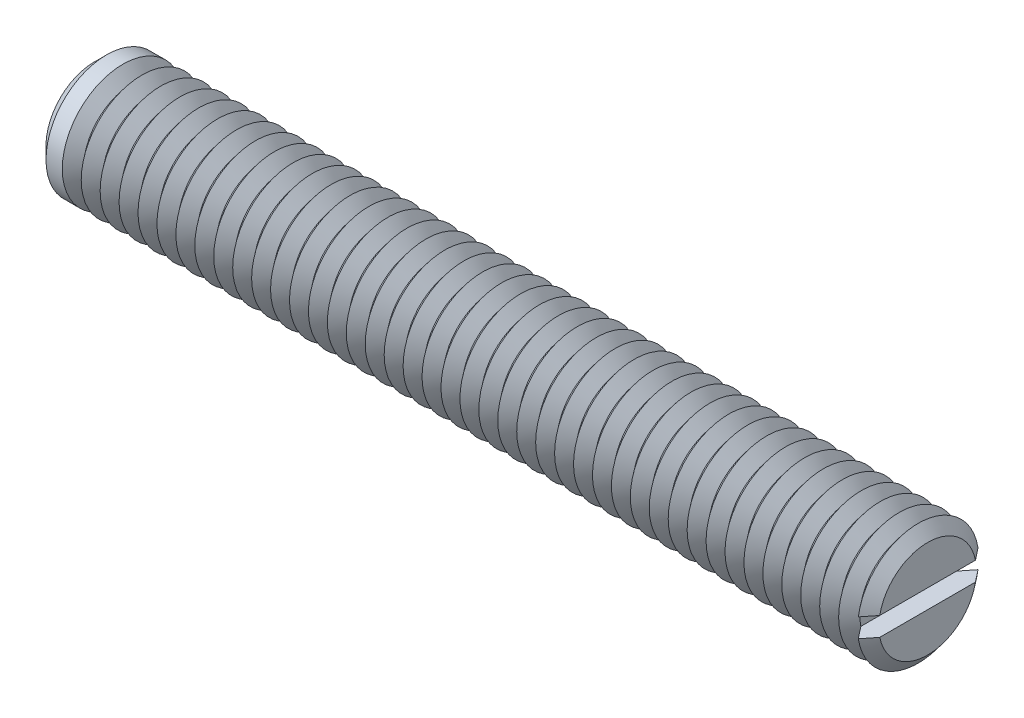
ISO-10303-21;
HEADER;
FILE_DESCRIPTION(('STEP AP214'),'2;1');
FILE_NAME('part.step','',(''),(''),'','','');
FILE_SCHEMA(('AUTOMOTIVE_DESIGN { 1 0 10303 214 1 1 1 1 }'));
ENDSEC;
DATA;
#1=APPLICATION_CONTEXT('core data for automotive mechanical design processes');
#2=APPLICATION_PROTOCOL_DEFINITION('international standard','automotive_design',2000,#1);
#3=PRODUCT_CONTEXT('',#1,'mechanical');
#4=PRODUCT('Part','Part','',(#3));
#5=PRODUCT_RELATED_PRODUCT_CATEGORY('part','',(#4));
#6=PRODUCT_DEFINITION_FORMATION('','',#4);
#7=PRODUCT_DEFINITION_CONTEXT('part definition',#1,'design');
#8=PRODUCT_DEFINITION('design','',#6,#7);
#9=PRODUCT_DEFINITION_SHAPE('','',#8);
#10=(LENGTH_UNIT() NAMED_UNIT(*) SI_UNIT(.MILLI.,.METRE.));
#11=(NAMED_UNIT(*) PLANE_ANGLE_UNIT() SI_UNIT($,.RADIAN.));
#12=(NAMED_UNIT(*) SI_UNIT($,.STERADIAN.) SOLID_ANGLE_UNIT());
#13=UNCERTAINTY_MEASURE_WITH_UNIT(LENGTH_MEASURE(1.E-05),#10,'distance_accuracy_value','');
#14=(GEOMETRIC_REPRESENTATION_CONTEXT(3) GLOBAL_UNCERTAINTY_ASSIGNED_CONTEXT((#13)) GLOBAL_UNIT_ASSIGNED_CONTEXT((#10,
#11,#12)) REPRESENTATION_CONTEXT('',''));
#15=CARTESIAN_POINT('',(0.,0.,0.));
#16=DIRECTION('',(0.,0.,1.));
#17=DIRECTION('',(1.,0.,0.));
#18=AXIS2_PLACEMENT_3D('',#15,#16,#17);
#19=CARTESIAN_POINT('',(26.875,0.,0.));
#20=DIRECTION('',(1.,0.,0.));
#21=DIRECTION('',(0.,0.,-1.));
#22=AXIS2_PLACEMENT_3D('',#19,#20,#21);
#23=CONICAL_SURFACE('',#22,4.,0.895664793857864);
#24=CARTESIAN_POINT('',(26.875,0.,0.));
#25=DIRECTION('',(-1.,0.,0.));
#26=DIRECTION('',(0.,0.,1.));
#27=AXIS2_PLACEMENT_3D('',#24,#25,#26);
#28=CIRCLE('',#27,4.);
#29=CARTESIAN_POINT('',(26.875,-0.625,-3.95087015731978));
#30=VERTEX_POINT('',#29);
#31=CARTESIAN_POINT('',(26.875,-0.625,3.95087015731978));
#32=VERTEX_POINT('',#31);
#33=EDGE_CURVE('E117',#30,#32,#28,.T.);
#34=ORIENTED_EDGE('',*,*,#33,.T.);
#35=CARTESIAN_POINT('',(30.6614902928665,-0.625,-8.70692181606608));
#36=CARTESIAN_POINT('',(30.4148555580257,-0.625,-8.39807520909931));
#37=CARTESIAN_POINT('',(30.1682552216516,-0.625,-8.08920109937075));
#38=CARTESIAN_POINT('',(29.6751408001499,-0.625,-7.47132164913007));
#39=CARTESIAN_POINT('',(29.4286267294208,-0.625,-7.16231629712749));
#40=CARTESIAN_POINT('',(28.9351922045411,-0.625,-6.54345822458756));
#41=CARTESIAN_POINT('',(28.6882721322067,-0.625,-6.23360519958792));
#42=CARTESIAN_POINT('',(28.1947157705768,-0.625,-5.61373487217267));
#43=CARTESIAN_POINT('',(27.9480794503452,-0.625,-5.30371759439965));
#44=CARTESIAN_POINT('',(27.5704817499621,-0.625,-4.82841623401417));
#45=CARTESIAN_POINT('',(27.4393680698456,-0.625,-4.66325315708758));
#46=CARTESIAN_POINT('',(27.1773052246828,-0.625,-4.33279290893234));
#47=CARTESIAN_POINT('',(27.0463560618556,-0.625,-4.16749573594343));
#48=CARTESIAN_POINT('',(26.7846416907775,-0.625,-3.8366527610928));
#49=CARTESIAN_POINT('',(26.6538765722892,-0.625,-3.67110688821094));
#50=CARTESIAN_POINT('',(26.392697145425,-0.625,-3.33975147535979));
#51=CARTESIAN_POINT('',(26.2622828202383,-0.625,-3.17394194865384));
#52=CARTESIAN_POINT('',(26.0022082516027,-0.625,-2.84217045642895));
#53=CARTESIAN_POINT('',(25.8725471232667,-0.625,-2.67620918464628));
#54=CARTESIAN_POINT('',(25.6140928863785,-0.625,-2.34356113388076));
#55=CARTESIAN_POINT('',(25.485299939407,-0.625,-2.17687422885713));
#56=CARTESIAN_POINT('',(25.2934479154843,-0.625,-1.92591523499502));
#57=CARTESIAN_POINT('',(25.2297426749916,-0.625,-1.84213757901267));
#58=CARTESIAN_POINT('',(25.1029724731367,-0.625,-1.67409978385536));
#59=CARTESIAN_POINT('',(25.0399075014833,-0.625,-1.58983965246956));
#60=CARTESIAN_POINT('',(24.9147785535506,-0.625,-1.42061659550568));
#61=CARTESIAN_POINT('',(24.8527142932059,-0.625,-1.33565388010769));
#62=CARTESIAN_POINT('',(24.7301881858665,-0.625,-1.16458302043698));
#63=CARTESIAN_POINT('',(24.6697261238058,-0.625,-1.0784750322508));
#64=CARTESIAN_POINT('',(24.5976838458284,-0.625,-0.972092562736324));
#65=CARTESIAN_POINT('',(24.5847024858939,-0.625,-0.95276797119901));
#66=CARTESIAN_POINT('',(24.5589128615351,-0.625,-0.914003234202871));
#67=CARTESIAN_POINT('',(24.5461046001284,-0.625,-0.894563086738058));
#68=CARTESIAN_POINT('',(24.5079767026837,-0.625,-0.836043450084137));
#69=CARTESIAN_POINT('',(24.4829560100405,-0.625,-0.796767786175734));
#70=CARTESIAN_POINT('',(24.4339776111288,-0.625,-0.717444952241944));
#71=CARTESIAN_POINT('',(24.4100221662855,-0.625,-0.677396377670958));
#72=CARTESIAN_POINT('',(24.3637207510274,-0.625,-0.596377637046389));
#73=CARTESIAN_POINT('',(24.341374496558,-0.625,-0.555407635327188));
#74=CARTESIAN_POINT('',(24.3059952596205,-0.625,-0.485816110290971));
#75=CARTESIAN_POINT('',(24.2923049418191,-0.625,-0.45753381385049));
#76=CARTESIAN_POINT('',(24.266378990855,-0.625,-0.400313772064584));
#77=CARTESIAN_POINT('',(24.2541438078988,-0.625,-0.371375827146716));
#78=CARTESIAN_POINT('',(24.2204304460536,-0.625,-0.283641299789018));
#79=CARTESIAN_POINT('',(24.2017774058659,-0.625,-0.223617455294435));
#80=CARTESIAN_POINT('',(24.1847644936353,-0.625,-0.13910293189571));
#81=CARTESIAN_POINT('',(24.18099555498,-0.625,-0.115688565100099));
#82=CARTESIAN_POINT('',(24.1755004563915,-0.625,-0.0686260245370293));
#83=CARTESIAN_POINT('',(24.1737732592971,-0.625,-0.0449779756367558));
#84=CARTESIAN_POINT('',(24.1724835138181,-0.625,0.00234331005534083));
#85=CARTESIAN_POINT('',(24.172917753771,-0.625,0.0260164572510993));
#86=CARTESIAN_POINT('',(24.1759063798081,-0.625,0.0732268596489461));
#87=CARTESIAN_POINT('',(24.1784611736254,-0.625,0.0967640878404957));
#88=CARTESIAN_POINT('',(24.191400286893,-0.625,0.182271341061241));
#89=CARTESIAN_POINT('',(24.207744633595,-0.625,0.243366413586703));
#90=CARTESIAN_POINT('',(24.2388887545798,-0.625,0.33266949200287));
#91=CARTESIAN_POINT('',(24.2504419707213,-0.625,0.362174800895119));
#92=CARTESIAN_POINT('',(24.2752210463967,-0.625,0.420481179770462));
#93=CARTESIAN_POINT('',(24.2884464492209,-0.625,0.449282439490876));
#94=CARTESIAN_POINT('',(24.3174677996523,-0.625,0.508972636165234));
#95=CARTESIAN_POINT('',(24.3333885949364,-0.625,0.539799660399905));
#96=CARTESIAN_POINT('',(24.3663425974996,-0.625,0.600856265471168));
#97=CARTESIAN_POINT('',(24.3833759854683,-0.625,0.631085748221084));
#98=CARTESIAN_POINT('',(24.4357348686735,-0.625,0.721100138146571));
#99=CARTESIAN_POINT('',(24.4722948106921,-0.625,0.780163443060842));
#100=CARTESIAN_POINT('',(24.5474296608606,-0.625,0.897183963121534));
#101=CARTESIAN_POINT('',(24.5860094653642,-0.625,0.955137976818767));
#102=CARTESIAN_POINT('',(24.6644096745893,-0.625,1.07020655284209));
#103=CARTESIAN_POINT('',(24.7042302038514,-0.625,1.12732103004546));
#104=CARTESIAN_POINT('',(24.7847841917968,-0.625,1.24108525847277));
#105=CARTESIAN_POINT('',(24.8255194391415,-0.625,1.29773373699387));
#106=CARTESIAN_POINT('',(24.9075780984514,-0.625,1.41061176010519));
#107=CARTESIAN_POINT('',(24.9489015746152,-0.625,1.46684125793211));
#108=CARTESIAN_POINT('',(25.0733456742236,-0.625,1.63486189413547));
#109=CARTESIAN_POINT('',(25.1570882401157,-0.625,1.74619171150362));
#110=CARTESIAN_POINT('',(25.3245788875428,-0.625,1.96690364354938));
#111=CARTESIAN_POINT('',(25.4083166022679,-0.625,2.07629366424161));
#112=CARTESIAN_POINT('',(25.5763821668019,-0.625,2.29462016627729));
#113=CARTESIAN_POINT('',(25.6607100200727,-0.625,2.40355664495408));
#114=CARTESIAN_POINT('',(25.9142762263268,-0.625,2.72992534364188));
#115=CARTESIAN_POINT('',(26.0840912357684,-0.625,2.94690900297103));
#116=CARTESIAN_POINT('',(26.4246141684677,-0.625,3.38042406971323));
#117=CARTESIAN_POINT('',(26.595322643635,-0.625,3.59695504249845));
#118=CARTESIAN_POINT('',(26.9371950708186,-0.625,4.02965109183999));
#119=CARTESIAN_POINT('',(27.1083590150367,-0.625,4.24581617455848));
#120=CARTESIAN_POINT('',(27.4504500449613,-0.625,4.67725748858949));
#121=CARTESIAN_POINT('',(27.6213762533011,-0.625,4.892534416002));
#122=CARTESIAN_POINT('',(27.9634226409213,-0.625,5.32293566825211));
#123=CARTESIAN_POINT('',(28.1345428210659,-0.625,5.53805999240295));
#124=CARTESIAN_POINT('',(28.6480384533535,-0.625,6.18319284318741));
#125=CARTESIAN_POINT('',(28.9906134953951,-0.625,6.61304248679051));
#126=CARTESIAN_POINT('',(29.4438892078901,-0.625,7.18140561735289));
#127=CARTESIAN_POINT('',(29.5544613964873,-0.625,7.32002163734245));
#128=CARTESIAN_POINT('',(29.7756363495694,-0.625,7.59723760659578));
#129=CARTESIAN_POINT('',(29.8862391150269,-0.625,7.73583755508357));
#130=CARTESIAN_POINT('',(30.1076076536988,-0.625,8.0131962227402));
#131=CARTESIAN_POINT('',(30.2183734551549,-0.625,8.1519549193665));
#132=CARTESIAN_POINT('',(30.4399202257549,-0.625,8.42945184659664));
#133=CARTESIAN_POINT('',(30.5507011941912,-0.625,8.56819007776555));
#134=CARTESIAN_POINT('',(30.6614902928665,-0.625,8.70692181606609));
#135=B_SPLINE_CURVE_WITH_KNOTS('',3,(#35,#36,#37,#38,#39,#40,#41,#42,#43,#44,#45,#46,#47,#48,
#49,#50,#51,#52,#53,#54,#55,#56,#57,#58,#59,#60,#61,#62,#63,#64,#65,#66,#67,#68,#69,#70,#71,#72,
#73,#74,#75,#76,#77,#78,#79,#80,#81,#82,#83,#84,#85,#86,#87,#88,#89,#90,#91,#92,#93,#94,#95,#96,
#97,#98,#99,#100,#101,#102,#103,#104,#105,#106,#107,#108,#109,#110,#111,#112,#113,#114,#115,
#116,#117,#118,#119,#120,#121,#122,#123,#124,#125,#126,#127,#128,#129,#130,#131,#132,#133,#134),
.UNSPECIFIED.,.F.,.F.,(4,2,2,2,2,2,2,2,2,2,2,2,2,2,2,2,2,2,2,2,2,2,2,2,2,2,2,2,2,2,2,2,2,2,2,2,
2,2,2,2,2,2,2,2,2,2,2,2,2,4),(0.,1.18572103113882,2.37158837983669,3.56020338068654,
4.74867342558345,5.3813081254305,6.01395126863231,6.64683693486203,7.27969171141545,
7.91151062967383,8.54344406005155,8.85918511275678,9.17492108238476,9.49056578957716,
9.80616791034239,9.8760068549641,9.94584701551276,10.0855382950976,10.2255132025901,
10.3654633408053,10.4596856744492,10.5539370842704,10.741396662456,10.8124690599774,
10.8835053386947,10.9544360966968,11.0253804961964,11.2137597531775,11.3088096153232,
11.403833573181,11.5078935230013,11.6119704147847,11.8202840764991,12.0291284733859,
12.2379939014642,12.4473111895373,12.6566515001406,13.0745694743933,13.4878513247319,
13.9011356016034,14.7277337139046,15.5549232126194,16.3820986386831,17.2067434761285,
18.0313920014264,19.6803778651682,20.2123228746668,20.7442873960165,21.2769292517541,
21.8095515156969),.UNSPECIFIED.);
#136=CARTESIAN_POINT('',(26.25,-0.625,3.1581247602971));
#137=VERTEX_POINT('',#136);
#138=EDGE_CURVE('E109',#137,#32,#135,.T.);
#139=ORIENTED_EDGE('',*,*,#138,.F.);
#140=CARTESIAN_POINT('',(26.25,0.,0.));
#141=DIRECTION('',(-1.,0.,0.));
#142=DIRECTION('',(0.,0.,1.));
#143=AXIS2_PLACEMENT_3D('',#140,#141,#142);
#144=CIRCLE('',#143,3.2193752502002);
#145=CARTESIAN_POINT('',(26.25,-0.625,-3.1581247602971));
#146=VERTEX_POINT('',#145);
#147=EDGE_CURVE('E560',#146,#137,#144,.T.);
#148=ORIENTED_EDGE('',*,*,#147,.F.);
#149=EDGE_CURVE('E58',#30,#146,#135,.T.);
#150=ORIENTED_EDGE('',*,*,#149,.F.);
#151=EDGE_LOOP('',(#34,#139,#148,#150));
#152=FACE_BOUND('',#151,.T.);
#153=ADVANCED_FACE('F37',(#152),#23,.T.);
#154=CARTESIAN_POINT('',(26.875,0.625,3.95087015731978));
#155=VERTEX_POINT('',#154);
#156=CARTESIAN_POINT('',(26.875,0.625,-3.95087015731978));
#157=VERTEX_POINT('',#156);
#158=EDGE_CURVE('E100',#155,#157,#28,.T.);
#159=ORIENTED_EDGE('',*,*,#158,.T.);
#160=CARTESIAN_POINT('',(30.6614902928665,0.625,8.70692181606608));
#161=CARTESIAN_POINT('',(30.4148555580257,0.625,8.39807520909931));
#162=CARTESIAN_POINT('',(30.1682552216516,0.625,8.08920109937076));
#163=CARTESIAN_POINT('',(29.67514080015,0.625,7.47132164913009));
#164=CARTESIAN_POINT('',(29.4286267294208,0.625,7.16231629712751));
#165=CARTESIAN_POINT('',(28.9351922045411,0.625,6.54345822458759));
#166=CARTESIAN_POINT('',(28.6882721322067,0.625,6.23360519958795));
#167=CARTESIAN_POINT('',(28.1947157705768,0.625,5.61373487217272));
#168=CARTESIAN_POINT('',(27.9480794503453,0.625,5.3037175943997));
#169=CARTESIAN_POINT('',(27.5704817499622,0.625,4.82841623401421));
#170=CARTESIAN_POINT('',(27.4393680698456,0.625,4.66325315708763));
#171=CARTESIAN_POINT('',(27.1773052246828,0.625,4.33279290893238));
#172=CARTESIAN_POINT('',(27.0463560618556,0.625,4.16749573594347));
#173=CARTESIAN_POINT('',(26.7846416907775,0.625,3.83665276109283));
#174=CARTESIAN_POINT('',(26.6538765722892,0.625,3.67110688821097));
#175=CARTESIAN_POINT('',(26.392697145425,0.625,3.33975147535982));
#176=CARTESIAN_POINT('',(26.2622828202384,0.625,3.17394194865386));
#177=CARTESIAN_POINT('',(26.0022082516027,0.625,2.84217045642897));
#178=CARTESIAN_POINT('',(25.8725471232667,0.625,2.6762091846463));
#179=CARTESIAN_POINT('',(25.6140928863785,0.625,2.34356113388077));
#180=CARTESIAN_POINT('',(25.485299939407,0.625,2.17687422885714));
#181=CARTESIAN_POINT('',(25.2934479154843,0.625,1.92591523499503));
#182=CARTESIAN_POINT('',(25.2297426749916,0.625,1.84213757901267));
#183=CARTESIAN_POINT('',(25.1029724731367,0.625,1.67409978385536));
#184=CARTESIAN_POINT('',(25.0399075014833,0.625,1.58983965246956));
#185=CARTESIAN_POINT('',(24.9147785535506,0.625,1.42061659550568));
#186=CARTESIAN_POINT('',(24.8527142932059,0.625,1.33565388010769));
#187=CARTESIAN_POINT('',(24.7301881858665,0.625,1.16458302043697));
#188=CARTESIAN_POINT('',(24.6697261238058,0.625,1.0784750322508));
#189=CARTESIAN_POINT('',(24.5976838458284,0.625,0.97209256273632));
#190=CARTESIAN_POINT('',(24.5847024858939,0.625,0.952767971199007));
#191=CARTESIAN_POINT('',(24.558912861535,0.625,0.914003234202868));
#192=CARTESIAN_POINT('',(24.5461046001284,0.625,0.894563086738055));
#193=CARTESIAN_POINT('',(24.5079767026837,0.625,0.836043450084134));
#194=CARTESIAN_POINT('',(24.4829560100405,0.625,0.796767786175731));
#195=CARTESIAN_POINT('',(24.4339776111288,0.625,0.717444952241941));
#196=CARTESIAN_POINT('',(24.4100221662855,0.625,0.677396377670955));
#197=CARTESIAN_POINT('',(24.3637207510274,0.625,0.596377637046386));
#198=CARTESIAN_POINT('',(24.3413744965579,0.625,0.555407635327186));
#199=CARTESIAN_POINT('',(24.3059952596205,0.625,0.485816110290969));
#200=CARTESIAN_POINT('',(24.2923049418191,0.625,0.457533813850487));
#201=CARTESIAN_POINT('',(24.266378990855,0.625,0.400313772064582));
#202=CARTESIAN_POINT('',(24.2541438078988,0.625,0.371375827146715));
#203=CARTESIAN_POINT('',(24.2204304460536,0.625,0.283641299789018));
#204=CARTESIAN_POINT('',(24.2017774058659,0.625,0.223617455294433));
#205=CARTESIAN_POINT('',(24.1847644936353,0.625,0.139102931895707));
#206=CARTESIAN_POINT('',(24.18099555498,0.625,0.115688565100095));
#207=CARTESIAN_POINT('',(24.1755004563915,0.625,0.0686260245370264));
#208=CARTESIAN_POINT('',(24.1737732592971,0.625,0.0449779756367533));
#209=CARTESIAN_POINT('',(24.1724835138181,0.625,-0.00234331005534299));
#210=CARTESIAN_POINT('',(24.172917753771,0.625,-0.0260164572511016));
#211=CARTESIAN_POINT('',(24.1759063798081,0.625,-0.0732268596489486));
#212=CARTESIAN_POINT('',(24.1784611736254,0.625,-0.0967640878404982));
#213=CARTESIAN_POINT('',(24.191400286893,0.625,-0.182271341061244));
#214=CARTESIAN_POINT('',(24.207744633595,0.625,-0.243366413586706));
#215=CARTESIAN_POINT('',(24.2388887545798,0.625,-0.332669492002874));
#216=CARTESIAN_POINT('',(24.2504419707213,0.625,-0.362174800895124));
#217=CARTESIAN_POINT('',(24.2752210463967,0.625,-0.420481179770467));
#218=CARTESIAN_POINT('',(24.2884464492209,0.625,-0.449282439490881));
#219=CARTESIAN_POINT('',(24.3174677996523,0.625,-0.50897263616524));
#220=CARTESIAN_POINT('',(24.3333885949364,0.625,-0.539799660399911));
#221=CARTESIAN_POINT('',(24.3663425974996,0.625,-0.600856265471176));
#222=CARTESIAN_POINT('',(24.3833759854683,0.625,-0.631085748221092));
#223=CARTESIAN_POINT('',(24.4357348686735,0.625,-0.721100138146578));
#224=CARTESIAN_POINT('',(24.4722948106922,0.625,-0.780163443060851));
#225=CARTESIAN_POINT('',(24.5474296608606,0.625,-0.897183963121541));
#226=CARTESIAN_POINT('',(24.5860094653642,0.625,-0.955137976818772));
#227=CARTESIAN_POINT('',(24.6644096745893,0.625,-1.0702065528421));
#228=CARTESIAN_POINT('',(24.7042302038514,0.625,-1.12732103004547));
#229=CARTESIAN_POINT('',(24.7847841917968,0.625,-1.24108525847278));
#230=CARTESIAN_POINT('',(24.8255194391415,0.625,-1.29773373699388));
#231=CARTESIAN_POINT('',(24.9075780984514,0.625,-1.4106117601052));
#232=CARTESIAN_POINT('',(24.9489015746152,0.625,-1.46684125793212));
#233=CARTESIAN_POINT('',(25.0733456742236,0.625,-1.63486189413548));
#234=CARTESIAN_POINT('',(25.1570882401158,0.625,-1.74619171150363));
#235=CARTESIAN_POINT('',(25.3245788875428,0.625,-1.9669036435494));
#236=CARTESIAN_POINT('',(25.4083166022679,0.625,-2.07629366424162));
#237=CARTESIAN_POINT('',(25.5763821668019,0.625,-2.29462016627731));
#238=CARTESIAN_POINT('',(25.6607100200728,0.625,-2.4035566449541));
#239=CARTESIAN_POINT('',(25.9142762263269,0.625,-2.7299253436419));
#240=CARTESIAN_POINT('',(26.0840912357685,0.625,-2.94690900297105));
#241=CARTESIAN_POINT('',(26.4246141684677,0.625,-3.38042406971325));
#242=CARTESIAN_POINT('',(26.595322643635,0.625,-3.59695504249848));
#243=CARTESIAN_POINT('',(26.9371950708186,0.625,-4.02965109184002));
#244=CARTESIAN_POINT('',(27.1083590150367,0.625,-4.24581617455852));
#245=CARTESIAN_POINT('',(27.4504500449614,0.625,-4.67725748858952));
#246=CARTESIAN_POINT('',(27.6213762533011,0.625,-4.89253441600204));
#247=CARTESIAN_POINT('',(27.9634226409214,0.625,-5.32293566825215));
#248=CARTESIAN_POINT('',(28.1345428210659,0.625,-5.53805999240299));
#249=CARTESIAN_POINT('',(28.6480384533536,0.625,-6.18319284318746));
#250=CARTESIAN_POINT('',(28.9906134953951,0.625,-6.61304248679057));
#251=CARTESIAN_POINT('',(29.4438892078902,0.625,-7.18140561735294));
#252=CARTESIAN_POINT('',(29.5544613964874,0.625,-7.32002163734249));
#253=CARTESIAN_POINT('',(29.7756363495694,0.625,-7.59723760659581));
#254=CARTESIAN_POINT('',(29.886239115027,0.625,-7.7358375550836));
#255=CARTESIAN_POINT('',(30.1076076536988,0.625,-8.01319622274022));
#256=CARTESIAN_POINT('',(30.2183734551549,0.625,-8.15195491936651));
#257=CARTESIAN_POINT('',(30.439920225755,0.625,-8.42945184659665));
#258=CARTESIAN_POINT('',(30.5507011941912,0.625,-8.56819007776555));
#259=CARTESIAN_POINT('',(30.6614902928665,0.625,-8.70692181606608));
#260=B_SPLINE_CURVE_WITH_KNOTS('',3,(#160,#161,#162,#163,#164,#165,#166,#167,#168,#169,#170,
#171,#172,#173,#174,#175,#176,#177,#178,#179,#180,#181,#182,#183,#184,#185,#186,#187,#188,#189,
#190,#191,#192,#193,#194,#195,#196,#197,#198,#199,#200,#201,#202,#203,#204,#205,#206,#207,#208,
#209,#210,#211,#212,#213,#214,#215,#216,#217,#218,#219,#220,#221,#222,#223,#224,#225,#226,#227,
#228,#229,#230,#231,#232,#233,#234,#235,#236,#237,#238,#239,#240,#241,#242,#243,#244,#245,#246,
#247,#248,#249,#250,#251,#252,#253,#254,#255,#256,#257,#258,#259),.UNSPECIFIED.,.F.,.F.,(4,2,2,
2,2,2,2,2,2,2,2,2,2,2,2,2,2,2,2,2,2,2,2,2,2,2,2,2,2,2,2,2,2,2,2,2,2,2,2,2,2,2,2,2,2,2,2,2,2,4),
(0.,1.18572103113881,2.37158837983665,3.56020338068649,4.74867342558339,5.38130812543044,
6.01395126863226,6.64683693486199,7.27969171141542,7.91151062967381,8.54344406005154,
8.85918511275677,9.17492108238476,9.49056578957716,9.8061679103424,9.8760068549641,
9.94584701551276,10.0855382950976,10.2255132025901,10.3654633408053,10.4596856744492,
10.5539370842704,10.741396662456,10.8124690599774,10.8835053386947,10.9544360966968,
11.0253804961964,11.2137597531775,11.3088096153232,11.403833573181,11.5078935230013,
11.6119704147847,11.8202840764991,12.0291284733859,12.2379939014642,12.4473111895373,
12.6566515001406,13.0745694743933,13.4878513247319,13.9011356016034,14.7277337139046,
15.5549232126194,16.3820986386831,17.2067434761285,18.0313920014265,19.6803778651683,
20.2123228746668,20.7442873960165,21.2769292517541,21.8095515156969),.UNSPECIFIED.);
#261=CARTESIAN_POINT('',(26.25,0.625,-3.1581247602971));
#262=VERTEX_POINT('',#261);
#263=EDGE_CURVE('E110',#262,#157,#260,.T.);
#264=ORIENTED_EDGE('',*,*,#263,.F.);
#265=CARTESIAN_POINT('',(26.25,0.625,3.1581247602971));
#266=VERTEX_POINT('',#265);
#267=EDGE_CURVE('E103',#266,#262,#144,.T.);
#268=ORIENTED_EDGE('',*,*,#267,.F.);
#269=EDGE_CURVE('E97',#155,#266,#260,.T.);
#270=ORIENTED_EDGE('',*,*,#269,.F.);
#271=EDGE_LOOP('',(#159,#264,#268,#270));
#272=FACE_BOUND('',#271,.T.);
#273=ADVANCED_FACE('F99',(#272),#23,.T.);
#274=CARTESIAN_POINT('',(26.25,0.,0.));
#275=DIRECTION('',(-1.,0.,0.));
#276=DIRECTION('',(0.,0.,1.));
#277=AXIS2_PLACEMENT_3D('',#274,#275,#276);
#278=CONICAL_SURFACE('',#277,3.2193752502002,0.895664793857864);
#279=CARTESIAN_POINT('',(25.625,0.,0.));
#280=DIRECTION('',(-1.,0.,0.));
#281=DIRECTION('',(0.,0.,1.));
#282=AXIS2_PLACEMENT_3D('',#279,#280,#281);
#283=CIRCLE('',#282,4.);
#284=CARTESIAN_POINT('',(25.625,0.,4.));
#285=VERTEX_POINT('',#284);
#286=EDGE_CURVE('E545',#285,#285,#283,.T.);
#287=ORIENTED_EDGE('',*,*,#286,.F.);
#288=EDGE_LOOP('',(#287));
#289=FACE_BOUND('',#288,.T.);
#290=ORIENTED_EDGE('',*,*,#267,.T.);
#291=EDGE_CURVE('E554',#262,#146,#144,.T.);
#292=ORIENTED_EDGE('',*,*,#291,.T.);
#293=ORIENTED_EDGE('',*,*,#147,.T.);
#294=EDGE_CURVE('E552',#137,#266,#144,.T.);
#295=ORIENTED_EDGE('',*,*,#294,.T.);
#296=EDGE_LOOP('',(#290,#292,#293,#295));
#297=FACE_BOUND('',#296,.T.);
#298=ADVANCED_FACE('F168',(#289,#297),#278,.T.);
#299=CARTESIAN_POINT('',(27.5,0.,0.));
#300=DIRECTION('',(1.,0.,0.));
#301=DIRECTION('',(0.,0.,-1.));
#302=AXIS2_PLACEMENT_3D('',#299,#300,#301);
#303=PLANE('',#302);
#304=CARTESIAN_POINT('',(27.5,0.,0.));
#305=DIRECTION('',(-1.,0.,0.));
#306=DIRECTION('',(0.,0.,1.));
#307=AXIS2_PLACEMENT_3D('',#304,#305,#306);
#308=CIRCLE('',#307,3.2193752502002);
#309=CARTESIAN_POINT('',(27.5,0.625,3.1581247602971));
#310=VERTEX_POINT('',#309);
#311=CARTESIAN_POINT('',(27.5,0.625,-3.1581247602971));
#312=VERTEX_POINT('',#311);
#313=EDGE_CURVE('E160',#310,#312,#308,.T.);
#314=ORIENTED_EDGE('',*,*,#313,.F.);
#315=DIRECTION('',(0.,0.,1.));
#316=VECTOR('',#315,1.);
#317=CARTESIAN_POINT('',(27.5,0.625,0.));
#318=LINE('',#317,#316);
#319=EDGE_CURVE('E122',#312,#310,#318,.T.);
#320=ORIENTED_EDGE('',*,*,#319,.F.);
#321=EDGE_LOOP('',(#314,#320));
#322=FACE_BOUND('',#321,.T.);
#323=ADVANCED_FACE('F172',(#322),#303,.T.);
#324=CARTESIAN_POINT('',(27.5,-0.625,-3.1581247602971));
#325=VERTEX_POINT('',#324);
#326=CARTESIAN_POINT('',(27.5,-0.625,3.1581247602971));
#327=VERTEX_POINT('',#326);
#328=EDGE_CURVE('E66',#325,#327,#308,.T.);
#329=ORIENTED_EDGE('',*,*,#328,.F.);
#330=DIRECTION('',(0.,0.,-1.));
#331=VECTOR('',#330,1.);
#332=CARTESIAN_POINT('',(27.5,-0.625,0.));
#333=LINE('',#332,#331);
#334=EDGE_CURVE('E136',#327,#325,#333,.T.);
#335=ORIENTED_EDGE('',*,*,#334,.F.);
#336=EDGE_LOOP('',(#329,#335));
#337=FACE_BOUND('',#336,.T.);
#338=ADVANCED_FACE('F201',(#337),#303,.T.);
#339=CARTESIAN_POINT('',(27.5,0.,0.));
#340=DIRECTION('',(-1.,0.,0.));
#341=DIRECTION('',(0.,0.,1.));
#342=AXIS2_PLACEMENT_3D('',#339,#340,#341);
#343=CONICAL_SURFACE('',#342,3.2193752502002,0.895664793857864);
#344=ORIENTED_EDGE('',*,*,#158,.F.);
#345=CARTESIAN_POINT('',(23.0885097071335,0.625,-8.70692181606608));
#346=CARTESIAN_POINT('',(23.3351444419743,0.625,-8.39807520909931));
#347=CARTESIAN_POINT('',(23.5817447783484,0.625,-8.08920109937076));
#348=CARTESIAN_POINT('',(24.07485919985,0.625,-7.47132164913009));
#349=CARTESIAN_POINT('',(24.3213732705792,0.625,-7.16231629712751));
#350=CARTESIAN_POINT('',(24.8148077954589,0.625,-6.54345822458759));
#351=CARTESIAN_POINT('',(25.0617278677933,0.625,-6.23360519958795));
#352=CARTESIAN_POINT('',(25.5552842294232,0.625,-5.61373487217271));
#353=CARTESIAN_POINT('',(25.8019205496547,0.625,-5.3037175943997));
#354=CARTESIAN_POINT('',(26.1795182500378,0.625,-4.82841623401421));
#355=CARTESIAN_POINT('',(26.3106319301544,0.625,-4.66325315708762));
#356=CARTESIAN_POINT('',(26.5726947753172,0.625,-4.33279290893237));
#357=CARTESIAN_POINT('',(26.7036439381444,0.625,-4.16749573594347));
#358=CARTESIAN_POINT('',(26.9653583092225,0.625,-3.83665276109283));
#359=CARTESIAN_POINT('',(27.0961234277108,0.625,-3.67110688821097));
#360=CARTESIAN_POINT('',(27.357302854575,0.625,-3.33975147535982));
#361=CARTESIAN_POINT('',(27.4877171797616,0.625,-3.17394194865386));
#362=CARTESIAN_POINT('',(27.7477917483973,0.625,-2.84217045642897));
#363=CARTESIAN_POINT('',(27.8774528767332,0.625,-2.6762091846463));
#364=CARTESIAN_POINT('',(28.1359071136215,0.625,-2.34356113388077));
#365=CARTESIAN_POINT('',(28.264700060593,0.625,-2.17687422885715));
#366=CARTESIAN_POINT('',(28.4565520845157,0.625,-1.92591523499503));
#367=CARTESIAN_POINT('',(28.5202573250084,0.625,-1.84213757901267));
#368=CARTESIAN_POINT('',(28.6470275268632,0.625,-1.67409978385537));
#369=CARTESIAN_POINT('',(28.7100924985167,0.625,-1.58983965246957));
#370=CARTESIAN_POINT('',(28.8352214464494,0.625,-1.42061659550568));
#371=CARTESIAN_POINT('',(28.8972857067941,0.625,-1.3356538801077));
#372=CARTESIAN_POINT('',(29.0198118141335,0.625,-1.16458302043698));
#373=CARTESIAN_POINT('',(29.0802738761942,0.625,-1.0784750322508));
#374=CARTESIAN_POINT('',(29.1523161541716,0.625,-0.97209256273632));
#375=CARTESIAN_POINT('',(29.1652975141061,0.625,-0.952767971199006));
#376=CARTESIAN_POINT('',(29.1910871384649,0.625,-0.914003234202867));
#377=CARTESIAN_POINT('',(29.2038953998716,0.625,-0.894563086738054));
#378=CARTESIAN_POINT('',(29.2420232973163,0.625,-0.836043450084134));
#379=CARTESIAN_POINT('',(29.2670439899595,0.625,-0.79676778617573));
#380=CARTESIAN_POINT('',(29.3160223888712,0.625,-0.717444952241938));
#381=CARTESIAN_POINT('',(29.3399778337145,0.625,-0.677396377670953));
#382=CARTESIAN_POINT('',(29.3862792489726,0.625,-0.596377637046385));
#383=CARTESIAN_POINT('',(29.4086255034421,0.625,-0.555407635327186));
#384=CARTESIAN_POINT('',(29.4440047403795,0.625,-0.485816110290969));
#385=CARTESIAN_POINT('',(29.4576950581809,0.625,-0.457533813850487));
#386=CARTESIAN_POINT('',(29.483621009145,0.625,-0.400313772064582));
#387=CARTESIAN_POINT('',(29.4958561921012,0.625,-0.371375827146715));
#388=CARTESIAN_POINT('',(29.5295695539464,0.625,-0.283641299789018));
#389=CARTESIAN_POINT('',(29.5482225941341,0.625,-0.223617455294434));
#390=CARTESIAN_POINT('',(29.5652355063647,0.625,-0.139102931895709));
#391=CARTESIAN_POINT('',(29.56900444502,0.625,-0.115688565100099));
#392=CARTESIAN_POINT('',(29.5744995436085,0.625,-0.06862602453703));
#393=CARTESIAN_POINT('',(29.5762267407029,0.625,-0.0449779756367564));
#394=CARTESIAN_POINT('',(29.5775164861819,0.625,0.00234331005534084));
#395=CARTESIAN_POINT('',(29.577082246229,0.625,0.0260164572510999));
#396=CARTESIAN_POINT('',(29.5740936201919,0.625,0.0732268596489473));
#397=CARTESIAN_POINT('',(29.5715388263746,0.625,0.0967640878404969));
#398=CARTESIAN_POINT('',(29.558599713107,0.625,0.182271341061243));
#399=CARTESIAN_POINT('',(29.542255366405,0.625,0.243366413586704));
#400=CARTESIAN_POINT('',(29.5111112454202,0.625,0.332669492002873));
#401=CARTESIAN_POINT('',(29.4995580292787,0.625,0.362174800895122));
#402=CARTESIAN_POINT('',(29.4747789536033,0.625,0.420481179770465));
#403=CARTESIAN_POINT('',(29.4615535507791,0.625,0.449282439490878));
#404=CARTESIAN_POINT('',(29.4325322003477,0.625,0.508972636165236));
#405=CARTESIAN_POINT('',(29.4166114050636,0.625,0.539799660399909));
#406=CARTESIAN_POINT('',(29.3836574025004,0.625,0.600856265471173));
#407=CARTESIAN_POINT('',(29.3666240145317,0.625,0.631085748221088));
#408=CARTESIAN_POINT('',(29.3142651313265,0.625,0.721100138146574));
#409=CARTESIAN_POINT('',(29.2777051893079,0.625,0.780163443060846));
#410=CARTESIAN_POINT('',(29.2025703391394,0.625,0.897183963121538));
#411=CARTESIAN_POINT('',(29.1639905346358,0.625,0.955137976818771));
#412=CARTESIAN_POINT('',(29.0855903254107,0.625,1.07020655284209));
#413=CARTESIAN_POINT('',(29.0457697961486,0.625,1.12732103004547));
#414=CARTESIAN_POINT('',(28.9652158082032,0.625,1.24108525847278));
#415=CARTESIAN_POINT('',(28.9244805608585,0.625,1.29773373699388));
#416=CARTESIAN_POINT('',(28.8424219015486,0.625,1.41061176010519));
#417=CARTESIAN_POINT('',(28.8010984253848,0.625,1.46684125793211));
#418=CARTESIAN_POINT('',(28.6766543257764,0.625,1.63486189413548));
#419=CARTESIAN_POINT('',(28.5929117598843,0.625,1.74619171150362));
#420=CARTESIAN_POINT('',(28.4254211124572,0.625,1.96690364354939));
#421=CARTESIAN_POINT('',(28.3416833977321,0.625,2.07629366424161));
#422=CARTESIAN_POINT('',(28.1736178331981,0.625,2.2946201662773));
#423=CARTESIAN_POINT('',(28.0892899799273,0.625,2.40355664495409));
#424=CARTESIAN_POINT('',(27.8357237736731,0.625,2.72992534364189));
#425=CARTESIAN_POINT('',(27.6659087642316,0.625,2.94690900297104));
#426=CARTESIAN_POINT('',(27.3253858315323,0.625,3.38042406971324));
#427=CARTESIAN_POINT('',(27.154677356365,0.625,3.59695504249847));
#428=CARTESIAN_POINT('',(26.8128049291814,0.625,4.02965109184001));
#429=CARTESIAN_POINT('',(26.6416409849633,0.625,4.2458161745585));
#430=CARTESIAN_POINT('',(26.2995499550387,0.625,4.6772574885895));
#431=CARTESIAN_POINT('',(26.1286237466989,0.625,4.89253441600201));
#432=CARTESIAN_POINT('',(25.7865773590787,0.625,5.32293566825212));
#433=CARTESIAN_POINT('',(25.6154571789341,0.625,5.53805999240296));
#434=CARTESIAN_POINT('',(25.1019615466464,0.625,6.18319284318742));
#435=CARTESIAN_POINT('',(24.7593865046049,0.625,6.61304248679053));
#436=CARTESIAN_POINT('',(24.3061107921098,0.625,7.1814056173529));
#437=CARTESIAN_POINT('',(24.1955386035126,0.625,7.32002163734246));
#438=CARTESIAN_POINT('',(23.9743636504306,0.625,7.59723760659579));
#439=CARTESIAN_POINT('',(23.863760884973,0.625,7.73583755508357));
#440=CARTESIAN_POINT('',(23.6423923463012,0.625,8.0131962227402));
#441=CARTESIAN_POINT('',(23.5316265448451,0.625,8.1519549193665));
#442=CARTESIAN_POINT('',(23.3100797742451,0.625,8.42945184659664));
#443=CARTESIAN_POINT('',(23.1992988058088,0.625,8.56819007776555));
#444=CARTESIAN_POINT('',(23.0885097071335,0.625,8.70692181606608));
#445=B_SPLINE_CURVE_WITH_KNOTS('',3,(#345,#346,#347,#348,#349,#350,#351,#352,#353,#354,#355,
#356,#357,#358,#359,#360,#361,#362,#363,#364,#365,#366,#367,#368,#369,#370,#371,#372,#373,#374,
#375,#376,#377,#378,#379,#380,#381,#382,#383,#384,#385,#386,#387,#388,#389,#390,#391,#392,#393,
#394,#395,#396,#397,#398,#399,#400,#401,#402,#403,#404,#405,#406,#407,#408,#409,#410,#411,#412,
#413,#414,#415,#416,#417,#418,#419,#420,#421,#422,#423,#424,#425,#426,#427,#428,#429,#430,#431,
#432,#433,#434,#435,#436,#437,#438,#439,#440,#441,#442,#443,#444),.UNSPECIFIED.,.F.,.F.,(4,2,2,
2,2,2,2,2,2,2,2,2,2,2,2,2,2,2,2,2,2,2,2,2,2,2,2,2,2,2,2,2,2,2,2,2,2,2,2,2,2,2,2,2,2,2,2,2,2,4),
(0.,1.18572103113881,2.37158837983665,3.56020338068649,4.74867342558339,5.38130812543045,
6.01395126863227,6.64683693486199,7.27969171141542,7.91151062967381,8.54344406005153,
8.85918511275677,9.17492108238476,9.49056578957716,9.8061679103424,9.8760068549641,
9.94584701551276,10.0855382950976,10.2255132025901,10.3654633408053,10.4596856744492,
10.5539370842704,10.741396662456,10.8124690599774,10.8835053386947,10.9544360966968,
11.0253804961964,11.2137597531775,11.3088096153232,11.403833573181,11.5078935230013,
11.6119704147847,11.8202840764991,12.0291284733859,12.2379939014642,12.4473111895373,
12.6566515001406,13.0745694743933,13.4878513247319,13.9011356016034,14.7277337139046,
15.5549232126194,16.3820986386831,17.2067434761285,18.0313920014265,19.6803778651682,
20.2123228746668,20.7442873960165,21.2769292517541,21.8095515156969),.UNSPECIFIED.);
#446=EDGE_CURVE('E41',#310,#155,#445,.T.);
#447=ORIENTED_EDGE('',*,*,#446,.F.);
#448=ORIENTED_EDGE('',*,*,#313,.T.);
#449=EDGE_CURVE('E11',#157,#312,#445,.T.);
#450=ORIENTED_EDGE('',*,*,#449,.F.);
#451=EDGE_LOOP('',(#344,#447,#448,#450));
#452=FACE_BOUND('',#451,.T.);
#453=ADVANCED_FACE('F114',(#452),#343,.T.);
#454=CARTESIAN_POINT('',(27.5,0.625,-6.));
#455=DIRECTION('',(0.,1.,0.));
#456=DIRECTION('',(0.,0.,1.));
#457=AXIS2_PLACEMENT_3D('',#454,#455,#456);
#458=PLANE('',#457);
#459=ORIENTED_EDGE('',*,*,#446,.T.);
#460=ORIENTED_EDGE('',*,*,#269,.T.);
#461=DIRECTION('',(0.,0.,1.));
#462=VECTOR('',#461,1.);
#463=CARTESIAN_POINT('',(26.25,0.625,-6.));
#464=LINE('',#463,#462);
#465=EDGE_CURVE('E145',#262,#266,#464,.T.);
#466=ORIENTED_EDGE('',*,*,#465,.F.);
#467=ORIENTED_EDGE('',*,*,#263,.T.);
#468=ORIENTED_EDGE('',*,*,#449,.T.);
#469=ORIENTED_EDGE('',*,*,#319,.T.);
#470=EDGE_LOOP('',(#459,#460,#466,#467,#468,#469));
#471=FACE_BOUND('',#470,.T.);
#472=ADVANCED_FACE('F120',(#471),#458,.F.);
#473=ORIENTED_EDGE('',*,*,#33,.F.);
#474=CARTESIAN_POINT('',(23.0885097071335,-0.625,8.70692181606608));
#475=CARTESIAN_POINT('',(23.3351444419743,-0.625,8.39807520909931));
#476=CARTESIAN_POINT('',(23.5817447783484,-0.625,8.08920109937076));
#477=CARTESIAN_POINT('',(24.0748591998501,-0.625,7.47132164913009));
#478=CARTESIAN_POINT('',(24.3213732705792,-0.625,7.16231629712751));
#479=CARTESIAN_POINT('',(24.8148077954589,-0.625,6.54345822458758));
#480=CARTESIAN_POINT('',(25.0617278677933,-0.625,6.23360519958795));
#481=CARTESIAN_POINT('',(25.5552842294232,-0.625,5.61373487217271));
#482=CARTESIAN_POINT('',(25.8019205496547,-0.625,5.30371759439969));
#483=CARTESIAN_POINT('',(26.1795182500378,-0.625,4.82841623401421));
#484=CARTESIAN_POINT('',(26.3106319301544,-0.625,4.66325315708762));
#485=CARTESIAN_POINT('',(26.5726947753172,-0.625,4.33279290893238));
#486=CARTESIAN_POINT('',(26.7036439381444,-0.625,4.16749573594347));
#487=CARTESIAN_POINT('',(26.9653583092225,-0.625,3.83665276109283));
#488=CARTESIAN_POINT('',(27.0961234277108,-0.625,3.67110688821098));
#489=CARTESIAN_POINT('',(27.357302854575,-0.625,3.33975147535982));
#490=CARTESIAN_POINT('',(27.4877171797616,-0.625,3.17394194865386));
#491=CARTESIAN_POINT('',(27.7477917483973,-0.625,2.84217045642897));
#492=CARTESIAN_POINT('',(27.8774528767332,-0.625,2.6762091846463));
#493=CARTESIAN_POINT('',(28.1359071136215,-0.625,2.34356113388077));
#494=CARTESIAN_POINT('',(28.264700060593,-0.625,2.17687422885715));
#495=CARTESIAN_POINT('',(28.4565520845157,-0.625,1.92591523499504));
#496=CARTESIAN_POINT('',(28.5202573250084,-0.625,1.84213757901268));
#497=CARTESIAN_POINT('',(28.6470275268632,-0.625,1.67409978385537));
#498=CARTESIAN_POINT('',(28.7100924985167,-0.625,1.58983965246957));
#499=CARTESIAN_POINT('',(28.8352214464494,-0.625,1.42061659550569));
#500=CARTESIAN_POINT('',(28.8972857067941,-0.625,1.3356538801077));
#501=CARTESIAN_POINT('',(29.0198118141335,-0.625,1.16458302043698));
#502=CARTESIAN_POINT('',(29.0802738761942,-0.625,1.0784750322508));
#503=CARTESIAN_POINT('',(29.1523161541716,-0.625,0.972092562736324));
#504=CARTESIAN_POINT('',(29.1652975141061,-0.625,0.952767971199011));
#505=CARTESIAN_POINT('',(29.1910871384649,-0.625,0.914003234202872));
#506=CARTESIAN_POINT('',(29.2038953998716,-0.625,0.894563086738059));
#507=CARTESIAN_POINT('',(29.2420232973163,-0.625,0.836043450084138));
#508=CARTESIAN_POINT('',(29.2670439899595,-0.625,0.796767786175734));
#509=CARTESIAN_POINT('',(29.3160223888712,-0.625,0.717444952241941));
#510=CARTESIAN_POINT('',(29.3399778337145,-0.625,0.677396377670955));
#511=CARTESIAN_POINT('',(29.3862792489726,-0.625,0.596377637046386));
#512=CARTESIAN_POINT('',(29.4086255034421,-0.625,0.555407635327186));
#513=CARTESIAN_POINT('',(29.4440047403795,-0.625,0.485816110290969));
#514=CARTESIAN_POINT('',(29.4576950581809,-0.625,0.457533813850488));
#515=CARTESIAN_POINT('',(29.483621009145,-0.625,0.400313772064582));
#516=CARTESIAN_POINT('',(29.4958561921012,-0.625,0.371375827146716));
#517=CARTESIAN_POINT('',(29.5295695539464,-0.625,0.283641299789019));
#518=CARTESIAN_POINT('',(29.5482225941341,-0.625,0.223617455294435));
#519=CARTESIAN_POINT('',(29.5652355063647,-0.625,0.139102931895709));
#520=CARTESIAN_POINT('',(29.56900444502,-0.625,0.115688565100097));
#521=CARTESIAN_POINT('',(29.5744995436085,-0.625,0.0686260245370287));
#522=CARTESIAN_POINT('',(29.5762267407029,-0.625,0.0449779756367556));
#523=CARTESIAN_POINT('',(29.5775164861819,-0.625,-0.00234331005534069));
#524=CARTESIAN_POINT('',(29.577082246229,-0.625,-0.0260164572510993));
#525=CARTESIAN_POINT('',(29.5740936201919,-0.625,-0.0732268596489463));
#526=CARTESIAN_POINT('',(29.5715388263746,-0.625,-0.096764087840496));
#527=CARTESIAN_POINT('',(29.558599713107,-0.625,-0.182271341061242));
#528=CARTESIAN_POINT('',(29.542255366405,-0.625,-0.243366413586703));
#529=CARTESIAN_POINT('',(29.5111112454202,-0.625,-0.33266949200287));
#530=CARTESIAN_POINT('',(29.4995580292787,-0.625,-0.362174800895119));
#531=CARTESIAN_POINT('',(29.4747789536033,-0.625,-0.420481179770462));
#532=CARTESIAN_POINT('',(29.4615535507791,-0.625,-0.449282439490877));
#533=CARTESIAN_POINT('',(29.4325322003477,-0.625,-0.508972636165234));
#534=CARTESIAN_POINT('',(29.4166114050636,-0.625,-0.539799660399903));
#535=CARTESIAN_POINT('',(29.3836574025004,-0.625,-0.600856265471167));
#536=CARTESIAN_POINT('',(29.3666240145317,-0.625,-0.631085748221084));
#537=CARTESIAN_POINT('',(29.3142651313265,-0.625,-0.721100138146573));
#538=CARTESIAN_POINT('',(29.2777051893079,-0.625,-0.780163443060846));
#539=CARTESIAN_POINT('',(29.2025703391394,-0.625,-0.897183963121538));
#540=CARTESIAN_POINT('',(29.1639905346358,-0.625,-0.955137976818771));
#541=CARTESIAN_POINT('',(29.0855903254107,-0.625,-1.07020655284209));
#542=CARTESIAN_POINT('',(29.0457697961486,-0.625,-1.12732103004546));
#543=CARTESIAN_POINT('',(28.9652158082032,-0.625,-1.24108525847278));
#544=CARTESIAN_POINT('',(28.9244805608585,-0.625,-1.29773373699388));
#545=CARTESIAN_POINT('',(28.8424219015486,-0.625,-1.41061176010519));
#546=CARTESIAN_POINT('',(28.8010984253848,-0.625,-1.46684125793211));
#547=CARTESIAN_POINT('',(28.6766543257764,-0.625,-1.63486189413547));
#548=CARTESIAN_POINT('',(28.5929117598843,-0.625,-1.74619171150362));
#549=CARTESIAN_POINT('',(28.4254211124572,-0.625,-1.96690364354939));
#550=CARTESIAN_POINT('',(28.3416833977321,-0.625,-2.07629366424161));
#551=CARTESIAN_POINT('',(28.1736178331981,-0.625,-2.29462016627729));
#552=CARTESIAN_POINT('',(28.0892899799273,-0.625,-2.40355664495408));
#553=CARTESIAN_POINT('',(27.8357237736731,-0.625,-2.72992534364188));
#554=CARTESIAN_POINT('',(27.6659087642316,-0.625,-2.94690900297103));
#555=CARTESIAN_POINT('',(27.3253858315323,-0.625,-3.38042406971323));
#556=CARTESIAN_POINT('',(27.154677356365,-0.625,-3.59695504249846));
#557=CARTESIAN_POINT('',(26.8128049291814,-0.625,-4.02965109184));
#558=CARTESIAN_POINT('',(26.6416409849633,-0.625,-4.24581617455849));
#559=CARTESIAN_POINT('',(26.2995499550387,-0.625,-4.67725748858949));
#560=CARTESIAN_POINT('',(26.1286237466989,-0.625,-4.892534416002));
#561=CARTESIAN_POINT('',(25.7865773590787,-0.625,-5.32293566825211));
#562=CARTESIAN_POINT('',(25.6154571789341,-0.625,-5.53805999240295));
#563=CARTESIAN_POINT('',(25.1019615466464,-0.625,-6.18319284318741));
#564=CARTESIAN_POINT('',(24.7593865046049,-0.625,-6.61304248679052));
#565=CARTESIAN_POINT('',(24.3061107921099,-0.625,-7.18140561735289));
#566=CARTESIAN_POINT('',(24.1955386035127,-0.625,-7.32002163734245));
#567=CARTESIAN_POINT('',(23.9743636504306,-0.625,-7.59723760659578));
#568=CARTESIAN_POINT('',(23.863760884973,-0.625,-7.73583755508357));
#569=CARTESIAN_POINT('',(23.6423923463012,-0.625,-8.0131962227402));
#570=CARTESIAN_POINT('',(23.5316265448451,-0.625,-8.1519549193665));
#571=CARTESIAN_POINT('',(23.310079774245,-0.625,-8.42945184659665));
#572=CARTESIAN_POINT('',(23.1992988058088,-0.625,-8.56819007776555));
#573=CARTESIAN_POINT('',(23.0885097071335,-0.625,-8.70692181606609));
#574=B_SPLINE_CURVE_WITH_KNOTS('',3,(#474,#475,#476,#477,#478,#479,#480,#481,#482,#483,#484,
#485,#486,#487,#488,#489,#490,#491,#492,#493,#494,#495,#496,#497,#498,#499,#500,#501,#502,#503,
#504,#505,#506,#507,#508,#509,#510,#511,#512,#513,#514,#515,#516,#517,#518,#519,#520,#521,#522,
#523,#524,#525,#526,#527,#528,#529,#530,#531,#532,#533,#534,#535,#536,#537,#538,#539,#540,#541,
#542,#543,#544,#545,#546,#547,#548,#549,#550,#551,#552,#553,#554,#555,#556,#557,#558,#559,#560,
#561,#562,#563,#564,#565,#566,#567,#568,#569,#570,#571,#572,#573),.UNSPECIFIED.,.F.,.F.,(4,2,2,
2,2,2,2,2,2,2,2,2,2,2,2,2,2,2,2,2,2,2,2,2,2,2,2,2,2,2,2,2,2,2,2,2,2,2,2,2,2,2,2,2,2,2,2,2,2,4),
(0.,1.18572103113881,2.37158837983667,3.5602033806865,4.7486734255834,5.38130812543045,
6.01395126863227,6.64683693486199,7.27969171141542,7.91151062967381,8.54344406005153,
8.85918511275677,9.17492108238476,9.49056578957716,9.8061679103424,9.8760068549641,
9.94584701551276,10.0855382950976,10.2255132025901,10.3654633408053,10.4596856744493,
10.5539370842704,10.741396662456,10.8124690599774,10.8835053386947,10.9544360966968,
11.0253804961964,11.2137597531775,11.3088096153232,11.403833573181,11.5078935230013,
11.6119704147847,11.8202840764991,12.0291284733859,12.2379939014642,12.4473111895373,
12.6566515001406,13.0745694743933,13.4878513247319,13.9011356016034,14.7277337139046,
15.5549232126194,16.3820986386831,17.2067434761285,18.0313920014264,19.6803778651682,
20.2123228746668,20.7442873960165,21.2769292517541,21.8095515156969),.UNSPECIFIED.);
#575=EDGE_CURVE('E152',#325,#30,#574,.T.);
#576=ORIENTED_EDGE('',*,*,#575,.F.);
#577=ORIENTED_EDGE('',*,*,#328,.T.);
#578=EDGE_CURVE('E148',#32,#327,#574,.T.);
#579=ORIENTED_EDGE('',*,*,#578,.F.);
#580=EDGE_LOOP('',(#473,#576,#577,#579));
#581=FACE_BOUND('',#580,.T.);
#582=ADVANCED_FACE('F164',(#581),#343,.T.);
#583=CARTESIAN_POINT('',(27.5,-0.625,-6.));
#584=DIRECTION('',(0.,-1.,0.));
#585=DIRECTION('',(0.,0.,-1.));
#586=AXIS2_PLACEMENT_3D('',#583,#584,#585);
#587=PLANE('',#586);
#588=ORIENTED_EDGE('',*,*,#575,.T.);
#589=ORIENTED_EDGE('',*,*,#149,.T.);
#590=DIRECTION('',(0.,0.,1.));
#591=VECTOR('',#590,1.);
#592=CARTESIAN_POINT('',(26.25,-0.625,-6.));
#593=LINE('',#592,#591);
#594=EDGE_CURVE('E144',#146,#137,#593,.T.);
#595=ORIENTED_EDGE('',*,*,#594,.T.);
#596=ORIENTED_EDGE('',*,*,#138,.T.);
#597=ORIENTED_EDGE('',*,*,#578,.T.);
#598=ORIENTED_EDGE('',*,*,#334,.T.);
#599=EDGE_LOOP('',(#588,#589,#595,#596,#597,#598));
#600=FACE_BOUND('',#599,.T.);
#601=ADVANCED_FACE('F161',(#600),#587,.F.);
#602=CARTESIAN_POINT('',(26.25,0.625,-6.));
#603=DIRECTION('',(-1.,0.,0.));
#604=DIRECTION('',(0.,0.,1.));
#605=AXIS2_PLACEMENT_3D('',#602,#603,#604);
#606=PLANE('',#605);
#607=ORIENTED_EDGE('',*,*,#594,.F.);
#608=ORIENTED_EDGE('',*,*,#291,.F.);
#609=ORIENTED_EDGE('',*,*,#465,.T.);
#610=ORIENTED_EDGE('',*,*,#294,.F.);
#611=EDGE_LOOP('',(#607,#608,#609,#610));
#612=FACE_BOUND('',#611,.T.);
#613=ADVANCED_FACE('F565',(#612),#606,.F.);
#614=CARTESIAN_POINT('',(25.,0.,0.));
#615=DIRECTION('',(-1.,0.,0.));
#616=DIRECTION('',(0.,0.,1.));
#617=AXIS2_PLACEMENT_3D('',#614,#615,#616);
#618=CONICAL_SURFACE('',#617,3.2193752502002,0.895664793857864);
#619=CARTESIAN_POINT('',(24.375,0.,0.));
#620=DIRECTION('',(-1.,0.,0.));
#621=DIRECTION('',(0.,0.,1.));
#622=AXIS2_PLACEMENT_3D('',#619,#620,#621);
#623=CIRCLE('',#622,4.);
#624=CARTESIAN_POINT('',(24.375,0.,4.));
#625=VERTEX_POINT('',#624);
#626=EDGE_CURVE('E537',#625,#625,#623,.T.);
#627=ORIENTED_EDGE('',*,*,#626,.F.);
#628=EDGE_LOOP('',(#627));
#629=FACE_BOUND('',#628,.T.);
#630=CARTESIAN_POINT('',(25.,0.,0.));
#631=DIRECTION('',(-1.,0.,0.));
#632=DIRECTION('',(0.,0.,1.));
#633=AXIS2_PLACEMENT_3D('',#630,#631,#632);
#634=CIRCLE('',#633,3.2193752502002);
#635=CARTESIAN_POINT('',(25.,0.,3.2193752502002));
#636=VERTEX_POINT('',#635);
#637=EDGE_CURVE('E549',#636,#636,#634,.T.);
#638=ORIENTED_EDGE('',*,*,#637,.T.);
#639=EDGE_LOOP('',(#638));
#640=FACE_BOUND('',#639,.T.);
#641=ADVANCED_FACE('F177',(#629,#640),#618,.T.);
#642=CARTESIAN_POINT('',(25.625,0.,0.));
#643=DIRECTION('',(1.,0.,0.));
#644=DIRECTION('',(0.,0.,-1.));
#645=AXIS2_PLACEMENT_3D('',#642,#643,#644);
#646=CONICAL_SURFACE('',#645,4.,0.895664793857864);
#647=ORIENTED_EDGE('',*,*,#637,.F.);
#648=EDGE_LOOP('',(#647));
#649=FACE_BOUND('',#648,.T.);
#650=ORIENTED_EDGE('',*,*,#286,.T.);
#651=EDGE_LOOP('',(#650));
#652=FACE_BOUND('',#651,.T.);
#653=ADVANCED_FACE('F571',(#649,#652),#646,.T.);
#654=CARTESIAN_POINT('',(23.75,0.,0.));
#655=DIRECTION('',(-1.,0.,0.));
#656=DIRECTION('',(0.,0.,1.));
#657=AXIS2_PLACEMENT_3D('',#654,#655,#656);
#658=CONICAL_SURFACE('',#657,3.2193752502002,0.895664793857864);
#659=CARTESIAN_POINT('',(23.125,0.,0.));
#660=DIRECTION('',(-1.,0.,0.));
#661=DIRECTION('',(0.,0.,1.));
#662=AXIS2_PLACEMENT_3D('',#659,#660,#661);
#663=CIRCLE('',#662,4.);
#664=CARTESIAN_POINT('',(23.125,0.,4.));
#665=VERTEX_POINT('',#664);
#666=EDGE_CURVE('E530',#665,#665,#663,.T.);
#667=ORIENTED_EDGE('',*,*,#666,.F.);
#668=EDGE_LOOP('',(#667));
#669=FACE_BOUND('',#668,.T.);
#670=CARTESIAN_POINT('',(23.75,0.,0.));
#671=DIRECTION('',(-1.,0.,0.));
#672=DIRECTION('',(0.,0.,1.));
#673=AXIS2_PLACEMENT_3D('',#670,#671,#672);
#674=CIRCLE('',#673,3.2193752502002);
#675=CARTESIAN_POINT('',(23.75,0.,3.2193752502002));
#676=VERTEX_POINT('',#675);
#677=EDGE_CURVE('E541',#676,#676,#674,.T.);
#678=ORIENTED_EDGE('',*,*,#677,.T.);
#679=EDGE_LOOP('',(#678));
#680=FACE_BOUND('',#679,.T.);
#681=ADVANCED_FACE('F635',(#669,#680),#658,.T.);
#682=CARTESIAN_POINT('',(24.375,0.,0.));
#683=DIRECTION('',(1.,0.,0.));
#684=DIRECTION('',(0.,0.,-1.));
#685=AXIS2_PLACEMENT_3D('',#682,#683,#684);
#686=CONICAL_SURFACE('',#685,4.,0.895664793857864);
#687=ORIENTED_EDGE('',*,*,#677,.F.);
#688=EDGE_LOOP('',(#687));
#689=FACE_BOUND('',#688,.T.);
#690=ORIENTED_EDGE('',*,*,#626,.T.);
#691=EDGE_LOOP('',(#690));
#692=FACE_BOUND('',#691,.T.);
#693=ADVANCED_FACE('F644',(#689,#692),#686,.T.);
#694=CARTESIAN_POINT('',(22.5,0.,0.));
#695=DIRECTION('',(-1.,0.,0.));
#696=DIRECTION('',(0.,0.,1.));
#697=AXIS2_PLACEMENT_3D('',#694,#695,#696);
#698=CONICAL_SURFACE('',#697,3.2193752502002,0.895664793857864);
#699=CARTESIAN_POINT('',(21.875,0.,0.));
#700=DIRECTION('',(-1.,0.,0.));
#701=DIRECTION('',(0.,0.,1.));
#702=AXIS2_PLACEMENT_3D('',#699,#700,#701);
#703=CIRCLE('',#702,4.);
#704=CARTESIAN_POINT('',(21.875,0.,4.));
#705=VERTEX_POINT('',#704);
#706=EDGE_CURVE('E522',#705,#705,#703,.T.);
#707=ORIENTED_EDGE('',*,*,#706,.F.);
#708=EDGE_LOOP('',(#707));
#709=FACE_BOUND('',#708,.T.);
#710=CARTESIAN_POINT('',(22.5,0.,0.));
#711=DIRECTION('',(-1.,0.,0.));
#712=DIRECTION('',(0.,0.,1.));
#713=AXIS2_PLACEMENT_3D('',#710,#711,#712);
#714=CIRCLE('',#713,3.2193752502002);
#715=CARTESIAN_POINT('',(22.5,0.,3.2193752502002));
#716=VERTEX_POINT('',#715);
#717=EDGE_CURVE('E534',#716,#716,#714,.T.);
#718=ORIENTED_EDGE('',*,*,#717,.T.);
#719=EDGE_LOOP('',(#718));
#720=FACE_BOUND('',#719,.T.);
#721=ADVANCED_FACE('F654',(#709,#720),#698,.T.);
#722=CARTESIAN_POINT('',(23.125,0.,0.));
#723=DIRECTION('',(1.,0.,0.));
#724=DIRECTION('',(0.,0.,-1.));
#725=AXIS2_PLACEMENT_3D('',#722,#723,#724);
#726=CONICAL_SURFACE('',#725,4.,0.895664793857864);
#727=ORIENTED_EDGE('',*,*,#717,.F.);
#728=EDGE_LOOP('',(#727));
#729=FACE_BOUND('',#728,.T.);
#730=ORIENTED_EDGE('',*,*,#666,.T.);
#731=EDGE_LOOP('',(#730));
#732=FACE_BOUND('',#731,.T.);
#733=ADVANCED_FACE('F664',(#729,#732),#726,.T.);
#734=CARTESIAN_POINT('',(21.25,0.,0.));
#735=DIRECTION('',(-1.,0.,0.));
#736=DIRECTION('',(0.,0.,1.));
#737=AXIS2_PLACEMENT_3D('',#734,#735,#736);
#738=CONICAL_SURFACE('',#737,3.2193752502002,0.895664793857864);
#739=CARTESIAN_POINT('',(20.625,0.,0.));
#740=DIRECTION('',(-1.,0.,0.));
#741=DIRECTION('',(0.,0.,1.));
#742=AXIS2_PLACEMENT_3D('',#739,#740,#741);
#743=CIRCLE('',#742,4.);
#744=CARTESIAN_POINT('',(20.625,0.,4.));
#745=VERTEX_POINT('',#744);
#746=EDGE_CURVE('E515',#745,#745,#743,.T.);
#747=ORIENTED_EDGE('',*,*,#746,.F.);
#748=EDGE_LOOP('',(#747));
#749=FACE_BOUND('',#748,.T.);
#750=CARTESIAN_POINT('',(21.25,0.,0.));
#751=DIRECTION('',(-1.,0.,0.));
#752=DIRECTION('',(0.,0.,1.));
#753=AXIS2_PLACEMENT_3D('',#750,#751,#752);
#754=CIRCLE('',#753,3.2193752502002);
#755=CARTESIAN_POINT('',(21.25,0.,3.2193752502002));
#756=VERTEX_POINT('',#755);
#757=EDGE_CURVE('E526',#756,#756,#754,.T.);
#758=ORIENTED_EDGE('',*,*,#757,.T.);
#759=EDGE_LOOP('',(#758));
#760=FACE_BOUND('',#759,.T.);
#761=ADVANCED_FACE('F674',(#749,#760),#738,.T.);
#762=CARTESIAN_POINT('',(21.875,0.,0.));
#763=DIRECTION('',(1.,0.,0.));
#764=DIRECTION('',(0.,0.,-1.));
#765=AXIS2_PLACEMENT_3D('',#762,#763,#764);
#766=CONICAL_SURFACE('',#765,4.,0.895664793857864);
#767=ORIENTED_EDGE('',*,*,#757,.F.);
#768=EDGE_LOOP('',(#767));
#769=FACE_BOUND('',#768,.T.);
#770=ORIENTED_EDGE('',*,*,#706,.T.);
#771=EDGE_LOOP('',(#770));
#772=FACE_BOUND('',#771,.T.);
#773=ADVANCED_FACE('F684',(#769,#772),#766,.T.);
#774=CARTESIAN_POINT('',(20.,0.,0.));
#775=DIRECTION('',(-1.,0.,0.));
#776=DIRECTION('',(0.,0.,1.));
#777=AXIS2_PLACEMENT_3D('',#774,#775,#776);
#778=CONICAL_SURFACE('',#777,3.2193752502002,0.895664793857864);
#779=CARTESIAN_POINT('',(19.375,0.,0.));
#780=DIRECTION('',(-1.,0.,0.));
#781=DIRECTION('',(0.,0.,1.));
#782=AXIS2_PLACEMENT_3D('',#779,#780,#781);
#783=CIRCLE('',#782,4.);
#784=CARTESIAN_POINT('',(19.375,0.,4.));
#785=VERTEX_POINT('',#784);
#786=EDGE_CURVE('E507',#785,#785,#783,.T.);
#787=ORIENTED_EDGE('',*,*,#786,.F.);
#788=EDGE_LOOP('',(#787));
#789=FACE_BOUND('',#788,.T.);
#790=CARTESIAN_POINT('',(20.,0.,0.));
#791=DIRECTION('',(-1.,0.,0.));
#792=DIRECTION('',(0.,0.,1.));
#793=AXIS2_PLACEMENT_3D('',#790,#791,#792);
#794=CIRCLE('',#793,3.2193752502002);
#795=CARTESIAN_POINT('',(20.,0.,3.2193752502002));
#796=VERTEX_POINT('',#795);
#797=EDGE_CURVE('E519',#796,#796,#794,.T.);
#798=ORIENTED_EDGE('',*,*,#797,.T.);
#799=EDGE_LOOP('',(#798));
#800=FACE_BOUND('',#799,.T.);
#801=ADVANCED_FACE('F694',(#789,#800),#778,.T.);
#802=CARTESIAN_POINT('',(20.625,0.,0.));
#803=DIRECTION('',(1.,0.,0.));
#804=DIRECTION('',(0.,0.,-1.));
#805=AXIS2_PLACEMENT_3D('',#802,#803,#804);
#806=CONICAL_SURFACE('',#805,4.,0.895664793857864);
#807=ORIENTED_EDGE('',*,*,#797,.F.);
#808=EDGE_LOOP('',(#807));
#809=FACE_BOUND('',#808,.T.);
#810=ORIENTED_EDGE('',*,*,#746,.T.);
#811=EDGE_LOOP('',(#810));
#812=FACE_BOUND('',#811,.T.);
#813=ADVANCED_FACE('F704',(#809,#812),#806,.T.);
#814=CARTESIAN_POINT('',(18.75,0.,0.));
#815=DIRECTION('',(-1.,0.,0.));
#816=DIRECTION('',(0.,0.,1.));
#817=AXIS2_PLACEMENT_3D('',#814,#815,#816);
#818=CONICAL_SURFACE('',#817,3.2193752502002,0.895664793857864);
#819=CARTESIAN_POINT('',(18.125,0.,0.));
#820=DIRECTION('',(-1.,0.,0.));
#821=DIRECTION('',(0.,0.,1.));
#822=AXIS2_PLACEMENT_3D('',#819,#820,#821);
#823=CIRCLE('',#822,4.);
#824=CARTESIAN_POINT('',(18.125,0.,4.));
#825=VERTEX_POINT('',#824);
#826=EDGE_CURVE('E499',#825,#825,#823,.T.);
#827=ORIENTED_EDGE('',*,*,#826,.F.);
#828=EDGE_LOOP('',(#827));
#829=FACE_BOUND('',#828,.T.);
#830=CARTESIAN_POINT('',(18.75,0.,0.));
#831=DIRECTION('',(-1.,0.,0.));
#832=DIRECTION('',(0.,0.,1.));
#833=AXIS2_PLACEMENT_3D('',#830,#831,#832);
#834=CIRCLE('',#833,3.2193752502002);
#835=CARTESIAN_POINT('',(18.75,0.,3.2193752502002));
#836=VERTEX_POINT('',#835);
#837=EDGE_CURVE('E511',#836,#836,#834,.T.);
#838=ORIENTED_EDGE('',*,*,#837,.T.);
#839=EDGE_LOOP('',(#838));
#840=FACE_BOUND('',#839,.T.);
#841=ADVANCED_FACE('F714',(#829,#840),#818,.T.);
#842=CARTESIAN_POINT('',(19.375,0.,0.));
#843=DIRECTION('',(1.,0.,0.));
#844=DIRECTION('',(0.,0.,-1.));
#845=AXIS2_PLACEMENT_3D('',#842,#843,#844);
#846=CONICAL_SURFACE('',#845,4.,0.895664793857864);
#847=ORIENTED_EDGE('',*,*,#837,.F.);
#848=EDGE_LOOP('',(#847));
#849=FACE_BOUND('',#848,.T.);
#850=ORIENTED_EDGE('',*,*,#786,.T.);
#851=EDGE_LOOP('',(#850));
#852=FACE_BOUND('',#851,.T.);
#853=ADVANCED_FACE('F724',(#849,#852),#846,.T.);
#854=CARTESIAN_POINT('',(17.5,0.,0.));
#855=DIRECTION('',(-1.,0.,0.));
#856=DIRECTION('',(0.,0.,1.));
#857=AXIS2_PLACEMENT_3D('',#854,#855,#856);
#858=CONICAL_SURFACE('',#857,3.2193752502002,0.895664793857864);
#859=CARTESIAN_POINT('',(16.875,0.,0.));
#860=DIRECTION('',(-1.,0.,0.));
#861=DIRECTION('',(0.,0.,1.));
#862=AXIS2_PLACEMENT_3D('',#859,#860,#861);
#863=CIRCLE('',#862,4.);
#864=CARTESIAN_POINT('',(16.875,0.,4.));
#865=VERTEX_POINT('',#864);
#866=EDGE_CURVE('E492',#865,#865,#863,.T.);
#867=ORIENTED_EDGE('',*,*,#866,.F.);
#868=EDGE_LOOP('',(#867));
#869=FACE_BOUND('',#868,.T.);
#870=CARTESIAN_POINT('',(17.5,0.,0.));
#871=DIRECTION('',(-1.,0.,0.));
#872=DIRECTION('',(0.,0.,1.));
#873=AXIS2_PLACEMENT_3D('',#870,#871,#872);
#874=CIRCLE('',#873,3.2193752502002);
#875=CARTESIAN_POINT('',(17.5,0.,3.2193752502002));
#876=VERTEX_POINT('',#875);
#877=EDGE_CURVE('E503',#876,#876,#874,.T.);
#878=ORIENTED_EDGE('',*,*,#877,.T.);
#879=EDGE_LOOP('',(#878));
#880=FACE_BOUND('',#879,.T.);
#881=ADVANCED_FACE('F734',(#869,#880),#858,.T.);
#882=CARTESIAN_POINT('',(18.125,0.,0.));
#883=DIRECTION('',(1.,0.,0.));
#884=DIRECTION('',(0.,0.,-1.));
#885=AXIS2_PLACEMENT_3D('',#882,#883,#884);
#886=CONICAL_SURFACE('',#885,4.,0.895664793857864);
#887=ORIENTED_EDGE('',*,*,#877,.F.);
#888=EDGE_LOOP('',(#887));
#889=FACE_BOUND('',#888,.T.);
#890=ORIENTED_EDGE('',*,*,#826,.T.);
#891=EDGE_LOOP('',(#890));
#892=FACE_BOUND('',#891,.T.);
#893=ADVANCED_FACE('F744',(#889,#892),#886,.T.);
#894=CARTESIAN_POINT('',(16.25,0.,0.));
#895=DIRECTION('',(-1.,0.,0.));
#896=DIRECTION('',(0.,0.,1.));
#897=AXIS2_PLACEMENT_3D('',#894,#895,#896);
#898=CONICAL_SURFACE('',#897,3.2193752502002,0.895664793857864);
#899=CARTESIAN_POINT('',(15.625,0.,0.));
#900=DIRECTION('',(-1.,0.,0.));
#901=DIRECTION('',(0.,0.,1.));
#902=AXIS2_PLACEMENT_3D('',#899,#900,#901);
#903=CIRCLE('',#902,4.);
#904=CARTESIAN_POINT('',(15.625,0.,4.));
#905=VERTEX_POINT('',#904);
#906=EDGE_CURVE('E484',#905,#905,#903,.T.);
#907=ORIENTED_EDGE('',*,*,#906,.F.);
#908=EDGE_LOOP('',(#907));
#909=FACE_BOUND('',#908,.T.);
#910=CARTESIAN_POINT('',(16.25,0.,0.));
#911=DIRECTION('',(-1.,0.,0.));
#912=DIRECTION('',(0.,0.,1.));
#913=AXIS2_PLACEMENT_3D('',#910,#911,#912);
#914=CIRCLE('',#913,3.2193752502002);
#915=CARTESIAN_POINT('',(16.25,0.,3.2193752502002));
#916=VERTEX_POINT('',#915);
#917=EDGE_CURVE('E495',#916,#916,#914,.T.);
#918=ORIENTED_EDGE('',*,*,#917,.T.);
#919=EDGE_LOOP('',(#918));
#920=FACE_BOUND('',#919,.T.);
#921=ADVANCED_FACE('F754',(#909,#920),#898,.T.);
#922=CARTESIAN_POINT('',(16.875,0.,0.));
#923=DIRECTION('',(1.,0.,0.));
#924=DIRECTION('',(0.,0.,-1.));
#925=AXIS2_PLACEMENT_3D('',#922,#923,#924);
#926=CONICAL_SURFACE('',#925,4.,0.895664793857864);
#927=ORIENTED_EDGE('',*,*,#917,.F.);
#928=EDGE_LOOP('',(#927));
#929=FACE_BOUND('',#928,.T.);
#930=ORIENTED_EDGE('',*,*,#866,.T.);
#931=EDGE_LOOP('',(#930));
#932=FACE_BOUND('',#931,.T.);
#933=ADVANCED_FACE('F764',(#929,#932),#926,.T.);
#934=CARTESIAN_POINT('',(15.,0.,0.));
#935=DIRECTION('',(-1.,0.,0.));
#936=DIRECTION('',(0.,0.,1.));
#937=AXIS2_PLACEMENT_3D('',#934,#935,#936);
#938=CONICAL_SURFACE('',#937,3.2193752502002,0.895664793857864);
#939=CARTESIAN_POINT('',(14.375,0.,0.));
#940=DIRECTION('',(-1.,0.,0.));
#941=DIRECTION('',(0.,0.,1.));
#942=AXIS2_PLACEMENT_3D('',#939,#940,#941);
#943=CIRCLE('',#942,4.);
#944=CARTESIAN_POINT('',(14.375,0.,4.));
#945=VERTEX_POINT('',#944);
#946=EDGE_CURVE('E476',#945,#945,#943,.T.);
#947=ORIENTED_EDGE('',*,*,#946,.F.);
#948=EDGE_LOOP('',(#947));
#949=FACE_BOUND('',#948,.T.);
#950=CARTESIAN_POINT('',(15.,0.,0.));
#951=DIRECTION('',(-1.,0.,0.));
#952=DIRECTION('',(0.,0.,1.));
#953=AXIS2_PLACEMENT_3D('',#950,#951,#952);
#954=CIRCLE('',#953,3.2193752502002);
#955=CARTESIAN_POINT('',(15.,0.,3.2193752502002));
#956=VERTEX_POINT('',#955);
#957=EDGE_CURVE('E488',#956,#956,#954,.T.);
#958=ORIENTED_EDGE('',*,*,#957,.T.);
#959=EDGE_LOOP('',(#958));
#960=FACE_BOUND('',#959,.T.);
#961=ADVANCED_FACE('F774',(#949,#960),#938,.T.);
#962=CARTESIAN_POINT('',(15.625,0.,0.));
#963=DIRECTION('',(1.,0.,0.));
#964=DIRECTION('',(0.,0.,-1.));
#965=AXIS2_PLACEMENT_3D('',#962,#963,#964);
#966=CONICAL_SURFACE('',#965,4.,0.895664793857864);
#967=ORIENTED_EDGE('',*,*,#957,.F.);
#968=EDGE_LOOP('',(#967));
#969=FACE_BOUND('',#968,.T.);
#970=ORIENTED_EDGE('',*,*,#906,.T.);
#971=EDGE_LOOP('',(#970));
#972=FACE_BOUND('',#971,.T.);
#973=ADVANCED_FACE('F784',(#969,#972),#966,.T.);
#974=CARTESIAN_POINT('',(13.75,0.,0.));
#975=DIRECTION('',(-1.,0.,0.));
#976=DIRECTION('',(0.,0.,1.));
#977=AXIS2_PLACEMENT_3D('',#974,#975,#976);
#978=CONICAL_SURFACE('',#977,3.2193752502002,0.895664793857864);
#979=CARTESIAN_POINT('',(13.125,0.,0.));
#980=DIRECTION('',(-1.,0.,0.));
#981=DIRECTION('',(0.,0.,1.));
#982=AXIS2_PLACEMENT_3D('',#979,#980,#981);
#983=CIRCLE('',#982,4.);
#984=CARTESIAN_POINT('',(13.125,0.,4.));
#985=VERTEX_POINT('',#984);
#986=EDGE_CURVE('E468',#985,#985,#983,.T.);
#987=ORIENTED_EDGE('',*,*,#986,.F.);
#988=EDGE_LOOP('',(#987));
#989=FACE_BOUND('',#988,.T.);
#990=CARTESIAN_POINT('',(13.75,0.,0.));
#991=DIRECTION('',(-1.,0.,0.));
#992=DIRECTION('',(0.,0.,1.));
#993=AXIS2_PLACEMENT_3D('',#990,#991,#992);
#994=CIRCLE('',#993,3.2193752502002);
#995=CARTESIAN_POINT('',(13.75,0.,3.2193752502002));
#996=VERTEX_POINT('',#995);
#997=EDGE_CURVE('E480',#996,#996,#994,.T.);
#998=ORIENTED_EDGE('',*,*,#997,.T.);
#999=EDGE_LOOP('',(#998));
#1000=FACE_BOUND('',#999,.T.);
#1001=ADVANCED_FACE('F794',(#989,#1000),#978,.T.);
#1002=CARTESIAN_POINT('',(14.375,0.,0.));
#1003=DIRECTION('',(1.,0.,0.));
#1004=DIRECTION('',(0.,0.,-1.));
#1005=AXIS2_PLACEMENT_3D('',#1002,#1003,#1004);
#1006=CONICAL_SURFACE('',#1005,4.,0.895664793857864);
#1007=ORIENTED_EDGE('',*,*,#997,.F.);
#1008=EDGE_LOOP('',(#1007));
#1009=FACE_BOUND('',#1008,.T.);
#1010=ORIENTED_EDGE('',*,*,#946,.T.);
#1011=EDGE_LOOP('',(#1010));
#1012=FACE_BOUND('',#1011,.T.);
#1013=ADVANCED_FACE('F804',(#1009,#1012),#1006,.T.);
#1014=CARTESIAN_POINT('',(12.5,0.,0.));
#1015=DIRECTION('',(-1.,0.,0.));
#1016=DIRECTION('',(0.,0.,1.));
#1017=AXIS2_PLACEMENT_3D('',#1014,#1015,#1016);
#1018=CONICAL_SURFACE('',#1017,3.2193752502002,0.895664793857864);
#1019=CARTESIAN_POINT('',(11.875,0.,0.));
#1020=DIRECTION('',(-1.,0.,0.));
#1021=DIRECTION('',(0.,0.,1.));
#1022=AXIS2_PLACEMENT_3D('',#1019,#1020,#1021);
#1023=CIRCLE('',#1022,4.);
#1024=CARTESIAN_POINT('',(11.875,0.,4.));
#1025=VERTEX_POINT('',#1024);
#1026=EDGE_CURVE('E461',#1025,#1025,#1023,.T.);
#1027=ORIENTED_EDGE('',*,*,#1026,.F.);
#1028=EDGE_LOOP('',(#1027));
#1029=FACE_BOUND('',#1028,.T.);
#1030=CARTESIAN_POINT('',(12.5,0.,0.));
#1031=DIRECTION('',(-1.,0.,0.));
#1032=DIRECTION('',(0.,0.,1.));
#1033=AXIS2_PLACEMENT_3D('',#1030,#1031,#1032);
#1034=CIRCLE('',#1033,3.2193752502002);
#1035=CARTESIAN_POINT('',(12.5,0.,3.2193752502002));
#1036=VERTEX_POINT('',#1035);
#1037=EDGE_CURVE('E472',#1036,#1036,#1034,.T.);
#1038=ORIENTED_EDGE('',*,*,#1037,.T.);
#1039=EDGE_LOOP('',(#1038));
#1040=FACE_BOUND('',#1039,.T.);
#1041=ADVANCED_FACE('F814',(#1029,#1040),#1018,.T.);
#1042=CARTESIAN_POINT('',(13.125,0.,0.));
#1043=DIRECTION('',(1.,0.,0.));
#1044=DIRECTION('',(0.,0.,-1.));
#1045=AXIS2_PLACEMENT_3D('',#1042,#1043,#1044);
#1046=CONICAL_SURFACE('',#1045,4.,0.895664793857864);
#1047=ORIENTED_EDGE('',*,*,#1037,.F.);
#1048=EDGE_LOOP('',(#1047));
#1049=FACE_BOUND('',#1048,.T.);
#1050=ORIENTED_EDGE('',*,*,#986,.T.);
#1051=EDGE_LOOP('',(#1050));
#1052=FACE_BOUND('',#1051,.T.);
#1053=ADVANCED_FACE('F824',(#1049,#1052),#1046,.T.);
#1054=CARTESIAN_POINT('',(11.25,0.,0.));
#1055=DIRECTION('',(-1.,0.,0.));
#1056=DIRECTION('',(0.,0.,1.));
#1057=AXIS2_PLACEMENT_3D('',#1054,#1055,#1056);
#1058=CONICAL_SURFACE('',#1057,3.2193752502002,0.895664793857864);
#1059=CARTESIAN_POINT('',(10.625,0.,0.));
#1060=DIRECTION('',(-1.,0.,0.));
#1061=DIRECTION('',(0.,0.,1.));
#1062=AXIS2_PLACEMENT_3D('',#1059,#1060,#1061);
#1063=CIRCLE('',#1062,4.);
#1064=CARTESIAN_POINT('',(10.625,0.,4.));
#1065=VERTEX_POINT('',#1064);
#1066=EDGE_CURVE('E453',#1065,#1065,#1063,.T.);
#1067=ORIENTED_EDGE('',*,*,#1066,.F.);
#1068=EDGE_LOOP('',(#1067));
#1069=FACE_BOUND('',#1068,.T.);
#1070=CARTESIAN_POINT('',(11.25,0.,0.));
#1071=DIRECTION('',(-1.,0.,0.));
#1072=DIRECTION('',(0.,0.,1.));
#1073=AXIS2_PLACEMENT_3D('',#1070,#1071,#1072);
#1074=CIRCLE('',#1073,3.2193752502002);
#1075=CARTESIAN_POINT('',(11.25,0.,3.2193752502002));
#1076=VERTEX_POINT('',#1075);
#1077=EDGE_CURVE('E464',#1076,#1076,#1074,.T.);
#1078=ORIENTED_EDGE('',*,*,#1077,.T.);
#1079=EDGE_LOOP('',(#1078));
#1080=FACE_BOUND('',#1079,.T.);
#1081=ADVANCED_FACE('F834',(#1069,#1080),#1058,.T.);
#1082=CARTESIAN_POINT('',(11.875,0.,0.));
#1083=DIRECTION('',(1.,0.,0.));
#1084=DIRECTION('',(0.,0.,-1.));
#1085=AXIS2_PLACEMENT_3D('',#1082,#1083,#1084);
#1086=CONICAL_SURFACE('',#1085,4.,0.895664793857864);
#1087=ORIENTED_EDGE('',*,*,#1077,.F.);
#1088=EDGE_LOOP('',(#1087));
#1089=FACE_BOUND('',#1088,.T.);
#1090=ORIENTED_EDGE('',*,*,#1026,.T.);
#1091=EDGE_LOOP('',(#1090));
#1092=FACE_BOUND('',#1091,.T.);
#1093=ADVANCED_FACE('F844',(#1089,#1092),#1086,.T.);
#1094=CARTESIAN_POINT('',(10.,0.,0.));
#1095=DIRECTION('',(-1.,0.,0.));
#1096=DIRECTION('',(0.,0.,1.));
#1097=AXIS2_PLACEMENT_3D('',#1094,#1095,#1096);
#1098=CONICAL_SURFACE('',#1097,3.2193752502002,0.895664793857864);
#1099=CARTESIAN_POINT('',(9.375,0.,0.));
#1100=DIRECTION('',(-1.,0.,0.));
#1101=DIRECTION('',(0.,0.,1.));
#1102=AXIS2_PLACEMENT_3D('',#1099,#1100,#1101);
#1103=CIRCLE('',#1102,4.);
#1104=CARTESIAN_POINT('',(9.375,0.,4.));
#1105=VERTEX_POINT('',#1104);
#1106=EDGE_CURVE('E445',#1105,#1105,#1103,.T.);
#1107=ORIENTED_EDGE('',*,*,#1106,.F.);
#1108=EDGE_LOOP('',(#1107));
#1109=FACE_BOUND('',#1108,.T.);
#1110=CARTESIAN_POINT('',(10.,0.,0.));
#1111=DIRECTION('',(-1.,0.,0.));
#1112=DIRECTION('',(0.,0.,1.));
#1113=AXIS2_PLACEMENT_3D('',#1110,#1111,#1112);
#1114=CIRCLE('',#1113,3.2193752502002);
#1115=CARTESIAN_POINT('',(10.,0.,3.2193752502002));
#1116=VERTEX_POINT('',#1115);
#1117=EDGE_CURVE('E457',#1116,#1116,#1114,.T.);
#1118=ORIENTED_EDGE('',*,*,#1117,.T.);
#1119=EDGE_LOOP('',(#1118));
#1120=FACE_BOUND('',#1119,.T.);
#1121=ADVANCED_FACE('F854',(#1109,#1120),#1098,.T.);
#1122=CARTESIAN_POINT('',(10.625,0.,0.));
#1123=DIRECTION('',(1.,0.,0.));
#1124=DIRECTION('',(0.,0.,-1.));
#1125=AXIS2_PLACEMENT_3D('',#1122,#1123,#1124);
#1126=CONICAL_SURFACE('',#1125,4.,0.895664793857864);
#1127=ORIENTED_EDGE('',*,*,#1117,.F.);
#1128=EDGE_LOOP('',(#1127));
#1129=FACE_BOUND('',#1128,.T.);
#1130=ORIENTED_EDGE('',*,*,#1066,.T.);
#1131=EDGE_LOOP('',(#1130));
#1132=FACE_BOUND('',#1131,.T.);
#1133=ADVANCED_FACE('F864',(#1129,#1132),#1126,.T.);
#1134=CARTESIAN_POINT('',(8.75,0.,0.));
#1135=DIRECTION('',(-1.,0.,0.));
#1136=DIRECTION('',(0.,0.,1.));
#1137=AXIS2_PLACEMENT_3D('',#1134,#1135,#1136);
#1138=CONICAL_SURFACE('',#1137,3.2193752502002,0.895664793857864);
#1139=CARTESIAN_POINT('',(8.125,0.,0.));
#1140=DIRECTION('',(-1.,0.,0.));
#1141=DIRECTION('',(0.,0.,1.));
#1142=AXIS2_PLACEMENT_3D('',#1139,#1140,#1141);
#1143=CIRCLE('',#1142,4.);
#1144=CARTESIAN_POINT('',(8.125,0.,4.));
#1145=VERTEX_POINT('',#1144);
#1146=EDGE_CURVE('E437',#1145,#1145,#1143,.T.);
#1147=ORIENTED_EDGE('',*,*,#1146,.F.);
#1148=EDGE_LOOP('',(#1147));
#1149=FACE_BOUND('',#1148,.T.);
#1150=CARTESIAN_POINT('',(8.75,0.,0.));
#1151=DIRECTION('',(-1.,0.,0.));
#1152=DIRECTION('',(0.,0.,1.));
#1153=AXIS2_PLACEMENT_3D('',#1150,#1151,#1152);
#1154=CIRCLE('',#1153,3.2193752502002);
#1155=CARTESIAN_POINT('',(8.75,0.,3.2193752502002));
#1156=VERTEX_POINT('',#1155);
#1157=EDGE_CURVE('E449',#1156,#1156,#1154,.T.);
#1158=ORIENTED_EDGE('',*,*,#1157,.T.);
#1159=EDGE_LOOP('',(#1158));
#1160=FACE_BOUND('',#1159,.T.);
#1161=ADVANCED_FACE('F874',(#1149,#1160),#1138,.T.);
#1162=CARTESIAN_POINT('',(9.375,0.,0.));
#1163=DIRECTION('',(1.,0.,0.));
#1164=DIRECTION('',(0.,0.,-1.));
#1165=AXIS2_PLACEMENT_3D('',#1162,#1163,#1164);
#1166=CONICAL_SURFACE('',#1165,4.,0.895664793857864);
#1167=ORIENTED_EDGE('',*,*,#1157,.F.);
#1168=EDGE_LOOP('',(#1167));
#1169=FACE_BOUND('',#1168,.T.);
#1170=ORIENTED_EDGE('',*,*,#1106,.T.);
#1171=EDGE_LOOP('',(#1170));
#1172=FACE_BOUND('',#1171,.T.);
#1173=ADVANCED_FACE('F884',(#1169,#1172),#1166,.T.);
#1174=CARTESIAN_POINT('',(7.5,0.,0.));
#1175=DIRECTION('',(-1.,0.,0.));
#1176=DIRECTION('',(0.,0.,1.));
#1177=AXIS2_PLACEMENT_3D('',#1174,#1175,#1176);
#1178=CONICAL_SURFACE('',#1177,3.2193752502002,0.895664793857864);
#1179=CARTESIAN_POINT('',(6.875,0.,0.));
#1180=DIRECTION('',(-1.,0.,0.));
#1181=DIRECTION('',(0.,0.,1.));
#1182=AXIS2_PLACEMENT_3D('',#1179,#1180,#1181);
#1183=CIRCLE('',#1182,4.);
#1184=CARTESIAN_POINT('',(6.875,0.,4.));
#1185=VERTEX_POINT('',#1184);
#1186=EDGE_CURVE('E429',#1185,#1185,#1183,.T.);
#1187=ORIENTED_EDGE('',*,*,#1186,.F.);
#1188=EDGE_LOOP('',(#1187));
#1189=FACE_BOUND('',#1188,.T.);
#1190=CARTESIAN_POINT('',(7.5,0.,0.));
#1191=DIRECTION('',(-1.,0.,0.));
#1192=DIRECTION('',(0.,0.,1.));
#1193=AXIS2_PLACEMENT_3D('',#1190,#1191,#1192);
#1194=CIRCLE('',#1193,3.2193752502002);
#1195=CARTESIAN_POINT('',(7.5,0.,3.2193752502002));
#1196=VERTEX_POINT('',#1195);
#1197=EDGE_CURVE('E441',#1196,#1196,#1194,.T.);
#1198=ORIENTED_EDGE('',*,*,#1197,.T.);
#1199=EDGE_LOOP('',(#1198));
#1200=FACE_BOUND('',#1199,.T.);
#1201=ADVANCED_FACE('F894',(#1189,#1200),#1178,.T.);
#1202=CARTESIAN_POINT('',(8.125,0.,0.));
#1203=DIRECTION('',(1.,0.,0.));
#1204=DIRECTION('',(0.,0.,-1.));
#1205=AXIS2_PLACEMENT_3D('',#1202,#1203,#1204);
#1206=CONICAL_SURFACE('',#1205,4.,0.895664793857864);
#1207=ORIENTED_EDGE('',*,*,#1197,.F.);
#1208=EDGE_LOOP('',(#1207));
#1209=FACE_BOUND('',#1208,.T.);
#1210=ORIENTED_EDGE('',*,*,#1146,.T.);
#1211=EDGE_LOOP('',(#1210));
#1212=FACE_BOUND('',#1211,.T.);
#1213=ADVANCED_FACE('F904',(#1209,#1212),#1206,.T.);
#1214=CARTESIAN_POINT('',(6.25,0.,0.));
#1215=DIRECTION('',(-1.,0.,0.));
#1216=DIRECTION('',(0.,0.,1.));
#1217=AXIS2_PLACEMENT_3D('',#1214,#1215,#1216);
#1218=CONICAL_SURFACE('',#1217,3.2193752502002,0.895664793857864);
#1219=CARTESIAN_POINT('',(5.625,0.,0.));
#1220=DIRECTION('',(-1.,0.,0.));
#1221=DIRECTION('',(0.,0.,1.));
#1222=AXIS2_PLACEMENT_3D('',#1219,#1220,#1221);
#1223=CIRCLE('',#1222,4.);
#1224=CARTESIAN_POINT('',(5.625,0.,4.));
#1225=VERTEX_POINT('',#1224);
#1226=EDGE_CURVE('E421',#1225,#1225,#1223,.T.);
#1227=ORIENTED_EDGE('',*,*,#1226,.F.);
#1228=EDGE_LOOP('',(#1227));
#1229=FACE_BOUND('',#1228,.T.);
#1230=CARTESIAN_POINT('',(6.25,0.,0.));
#1231=DIRECTION('',(-1.,0.,0.));
#1232=DIRECTION('',(0.,0.,1.));
#1233=AXIS2_PLACEMENT_3D('',#1230,#1231,#1232);
#1234=CIRCLE('',#1233,3.2193752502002);
#1235=CARTESIAN_POINT('',(6.25,0.,3.2193752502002));
#1236=VERTEX_POINT('',#1235);
#1237=EDGE_CURVE('E433',#1236,#1236,#1234,.T.);
#1238=ORIENTED_EDGE('',*,*,#1237,.T.);
#1239=EDGE_LOOP('',(#1238));
#1240=FACE_BOUND('',#1239,.T.);
#1241=ADVANCED_FACE('F914',(#1229,#1240),#1218,.T.);
#1242=CARTESIAN_POINT('',(6.875,0.,0.));
#1243=DIRECTION('',(1.,0.,0.));
#1244=DIRECTION('',(0.,0.,-1.));
#1245=AXIS2_PLACEMENT_3D('',#1242,#1243,#1244);
#1246=CONICAL_SURFACE('',#1245,4.,0.895664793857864);
#1247=ORIENTED_EDGE('',*,*,#1237,.F.);
#1248=EDGE_LOOP('',(#1247));
#1249=FACE_BOUND('',#1248,.T.);
#1250=ORIENTED_EDGE('',*,*,#1186,.T.);
#1251=EDGE_LOOP('',(#1250));
#1252=FACE_BOUND('',#1251,.T.);
#1253=ADVANCED_FACE('F924',(#1249,#1252),#1246,.T.);
#1254=CARTESIAN_POINT('',(5.,0.,0.));
#1255=DIRECTION('',(-1.,0.,0.));
#1256=DIRECTION('',(0.,0.,1.));
#1257=AXIS2_PLACEMENT_3D('',#1254,#1255,#1256);
#1258=CONICAL_SURFACE('',#1257,3.2193752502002,0.895664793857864);
#1259=CARTESIAN_POINT('',(4.375,0.,0.));
#1260=DIRECTION('',(-1.,0.,0.));
#1261=DIRECTION('',(0.,0.,1.));
#1262=AXIS2_PLACEMENT_3D('',#1259,#1260,#1261);
#1263=CIRCLE('',#1262,4.);
#1264=CARTESIAN_POINT('',(4.375,0.,4.));
#1265=VERTEX_POINT('',#1264);
#1266=EDGE_CURVE('E413',#1265,#1265,#1263,.T.);
#1267=ORIENTED_EDGE('',*,*,#1266,.F.);
#1268=EDGE_LOOP('',(#1267));
#1269=FACE_BOUND('',#1268,.T.);
#1270=CARTESIAN_POINT('',(5.,0.,0.));
#1271=DIRECTION('',(-1.,0.,0.));
#1272=DIRECTION('',(0.,0.,1.));
#1273=AXIS2_PLACEMENT_3D('',#1270,#1271,#1272);
#1274=CIRCLE('',#1273,3.2193752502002);
#1275=CARTESIAN_POINT('',(5.,0.,3.2193752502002));
#1276=VERTEX_POINT('',#1275);
#1277=EDGE_CURVE('E425',#1276,#1276,#1274,.T.);
#1278=ORIENTED_EDGE('',*,*,#1277,.T.);
#1279=EDGE_LOOP('',(#1278));
#1280=FACE_BOUND('',#1279,.T.);
#1281=ADVANCED_FACE('F934',(#1269,#1280),#1258,.T.);
#1282=CARTESIAN_POINT('',(5.625,0.,0.));
#1283=DIRECTION('',(1.,0.,0.));
#1284=DIRECTION('',(0.,0.,-1.));
#1285=AXIS2_PLACEMENT_3D('',#1282,#1283,#1284);
#1286=CONICAL_SURFACE('',#1285,4.,0.895664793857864);
#1287=ORIENTED_EDGE('',*,*,#1277,.F.);
#1288=EDGE_LOOP('',(#1287));
#1289=FACE_BOUND('',#1288,.T.);
#1290=ORIENTED_EDGE('',*,*,#1226,.T.);
#1291=EDGE_LOOP('',(#1290));
#1292=FACE_BOUND('',#1291,.T.);
#1293=ADVANCED_FACE('F944',(#1289,#1292),#1286,.T.);
#1294=CARTESIAN_POINT('',(3.75,0.,0.));
#1295=DIRECTION('',(-1.,0.,0.));
#1296=DIRECTION('',(0.,0.,1.));
#1297=AXIS2_PLACEMENT_3D('',#1294,#1295,#1296);
#1298=CONICAL_SURFACE('',#1297,3.2193752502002,0.895664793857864);
#1299=CARTESIAN_POINT('',(3.125,0.,0.));
#1300=DIRECTION('',(-1.,0.,0.));
#1301=DIRECTION('',(0.,0.,1.));
#1302=AXIS2_PLACEMENT_3D('',#1299,#1300,#1301);
#1303=CIRCLE('',#1302,4.);
#1304=CARTESIAN_POINT('',(3.125,0.,4.));
#1305=VERTEX_POINT('',#1304);
#1306=EDGE_CURVE('E405',#1305,#1305,#1303,.T.);
#1307=ORIENTED_EDGE('',*,*,#1306,.F.);
#1308=EDGE_LOOP('',(#1307));
#1309=FACE_BOUND('',#1308,.T.);
#1310=CARTESIAN_POINT('',(3.75,0.,0.));
#1311=DIRECTION('',(-1.,0.,0.));
#1312=DIRECTION('',(0.,0.,1.));
#1313=AXIS2_PLACEMENT_3D('',#1310,#1311,#1312);
#1314=CIRCLE('',#1313,3.2193752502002);
#1315=CARTESIAN_POINT('',(3.75,0.,3.2193752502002));
#1316=VERTEX_POINT('',#1315);
#1317=EDGE_CURVE('E417',#1316,#1316,#1314,.T.);
#1318=ORIENTED_EDGE('',*,*,#1317,.T.);
#1319=EDGE_LOOP('',(#1318));
#1320=FACE_BOUND('',#1319,.T.);
#1321=ADVANCED_FACE('F954',(#1309,#1320),#1298,.T.);
#1322=CARTESIAN_POINT('',(4.375,0.,0.));
#1323=DIRECTION('',(1.,0.,0.));
#1324=DIRECTION('',(0.,0.,-1.));
#1325=AXIS2_PLACEMENT_3D('',#1322,#1323,#1324);
#1326=CONICAL_SURFACE('',#1325,4.,0.895664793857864);
#1327=ORIENTED_EDGE('',*,*,#1317,.F.);
#1328=EDGE_LOOP('',(#1327));
#1329=FACE_BOUND('',#1328,.T.);
#1330=ORIENTED_EDGE('',*,*,#1266,.T.);
#1331=EDGE_LOOP('',(#1330));
#1332=FACE_BOUND('',#1331,.T.);
#1333=ADVANCED_FACE('F964',(#1329,#1332),#1326,.T.);
#1334=CARTESIAN_POINT('',(2.5,0.,0.));
#1335=DIRECTION('',(-1.,0.,0.));
#1336=DIRECTION('',(0.,0.,1.));
#1337=AXIS2_PLACEMENT_3D('',#1334,#1335,#1336);
#1338=CONICAL_SURFACE('',#1337,3.2193752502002,0.895664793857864);
#1339=CARTESIAN_POINT('',(1.875,0.,0.));
#1340=DIRECTION('',(-1.,0.,0.));
#1341=DIRECTION('',(0.,0.,1.));
#1342=AXIS2_PLACEMENT_3D('',#1339,#1340,#1341);
#1343=CIRCLE('',#1342,4.);
#1344=CARTESIAN_POINT('',(1.875,0.,4.));
#1345=VERTEX_POINT('',#1344);
#1346=EDGE_CURVE('E397',#1345,#1345,#1343,.T.);
#1347=ORIENTED_EDGE('',*,*,#1346,.F.);
#1348=EDGE_LOOP('',(#1347));
#1349=FACE_BOUND('',#1348,.T.);
#1350=CARTESIAN_POINT('',(2.5,0.,0.));
#1351=DIRECTION('',(-1.,0.,0.));
#1352=DIRECTION('',(0.,0.,1.));
#1353=AXIS2_PLACEMENT_3D('',#1350,#1351,#1352);
#1354=CIRCLE('',#1353,3.2193752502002);
#1355=CARTESIAN_POINT('',(2.5,0.,3.2193752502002));
#1356=VERTEX_POINT('',#1355);
#1357=EDGE_CURVE('E409',#1356,#1356,#1354,.T.);
#1358=ORIENTED_EDGE('',*,*,#1357,.T.);
#1359=EDGE_LOOP('',(#1358));
#1360=FACE_BOUND('',#1359,.T.);
#1361=ADVANCED_FACE('F974',(#1349,#1360),#1338,.T.);
#1362=CARTESIAN_POINT('',(3.125,0.,0.));
#1363=DIRECTION('',(1.,0.,0.));
#1364=DIRECTION('',(0.,0.,-1.));
#1365=AXIS2_PLACEMENT_3D('',#1362,#1363,#1364);
#1366=CONICAL_SURFACE('',#1365,4.,0.895664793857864);
#1367=ORIENTED_EDGE('',*,*,#1357,.F.);
#1368=EDGE_LOOP('',(#1367));
#1369=FACE_BOUND('',#1368,.T.);
#1370=ORIENTED_EDGE('',*,*,#1306,.T.);
#1371=EDGE_LOOP('',(#1370));
#1372=FACE_BOUND('',#1371,.T.);
#1373=ADVANCED_FACE('F984',(#1369,#1372),#1366,.T.);
#1374=CARTESIAN_POINT('',(1.25,0.,0.));
#1375=DIRECTION('',(-1.,0.,0.));
#1376=DIRECTION('',(0.,0.,1.));
#1377=AXIS2_PLACEMENT_3D('',#1374,#1375,#1376);
#1378=CONICAL_SURFACE('',#1377,3.2193752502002,0.895664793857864);
#1379=CARTESIAN_POINT('',(0.625000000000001,0.,0.));
#1380=DIRECTION('',(-1.,0.,0.));
#1381=DIRECTION('',(0.,0.,1.));
#1382=AXIS2_PLACEMENT_3D('',#1379,#1380,#1381);
#1383=CIRCLE('',#1382,4.);
#1384=CARTESIAN_POINT('',(0.625000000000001,0.,4.));
#1385=VERTEX_POINT('',#1384);
#1386=EDGE_CURVE('E389',#1385,#1385,#1383,.T.);
#1387=ORIENTED_EDGE('',*,*,#1386,.F.);
#1388=EDGE_LOOP('',(#1387));
#1389=FACE_BOUND('',#1388,.T.);
#1390=CARTESIAN_POINT('',(1.25,0.,0.));
#1391=DIRECTION('',(-1.,0.,0.));
#1392=DIRECTION('',(0.,0.,1.));
#1393=AXIS2_PLACEMENT_3D('',#1390,#1391,#1392);
#1394=CIRCLE('',#1393,3.2193752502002);
#1395=CARTESIAN_POINT('',(1.25,0.,3.2193752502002));
#1396=VERTEX_POINT('',#1395);
#1397=EDGE_CURVE('E401',#1396,#1396,#1394,.T.);
#1398=ORIENTED_EDGE('',*,*,#1397,.T.);
#1399=EDGE_LOOP('',(#1398));
#1400=FACE_BOUND('',#1399,.T.);
#1401=ADVANCED_FACE('F994',(#1389,#1400),#1378,.T.);
#1402=CARTESIAN_POINT('',(1.875,0.,0.));
#1403=DIRECTION('',(1.,0.,0.));
#1404=DIRECTION('',(0.,0.,-1.));
#1405=AXIS2_PLACEMENT_3D('',#1402,#1403,#1404);
#1406=CONICAL_SURFACE('',#1405,4.,0.895664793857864);
#1407=ORIENTED_EDGE('',*,*,#1397,.F.);
#1408=EDGE_LOOP('',(#1407));
#1409=FACE_BOUND('',#1408,.T.);
#1410=ORIENTED_EDGE('',*,*,#1346,.T.);
#1411=EDGE_LOOP('',(#1410));
#1412=FACE_BOUND('',#1411,.T.);
#1413=ADVANCED_FACE('F1004',(#1409,#1412),#1406,.T.);
#1414=CARTESIAN_POINT('',(0.,0.,0.));
#1415=DIRECTION('',(-1.,0.,0.));
#1416=DIRECTION('',(0.,0.,1.));
#1417=AXIS2_PLACEMENT_3D('',#1414,#1415,#1416);
#1418=CONICAL_SURFACE('',#1417,3.2193752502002,0.895664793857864);
#1419=CARTESIAN_POINT('',(-0.625000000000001,0.,0.));
#1420=DIRECTION('',(-1.,0.,0.));
#1421=DIRECTION('',(0.,0.,1.));
#1422=AXIS2_PLACEMENT_3D('',#1419,#1420,#1421);
#1423=CIRCLE('',#1422,4.);
#1424=CARTESIAN_POINT('',(-0.625000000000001,0.,4.));
#1425=VERTEX_POINT('',#1424);
#1426=EDGE_CURVE('E381',#1425,#1425,#1423,.T.);
#1427=ORIENTED_EDGE('',*,*,#1426,.F.);
#1428=EDGE_LOOP('',(#1427));
#1429=FACE_BOUND('',#1428,.T.);
#1430=CARTESIAN_POINT('',(0.,0.,0.));
#1431=DIRECTION('',(-1.,0.,0.));
#1432=DIRECTION('',(0.,0.,1.));
#1433=AXIS2_PLACEMENT_3D('',#1430,#1431,#1432);
#1434=CIRCLE('',#1433,3.2193752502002);
#1435=CARTESIAN_POINT('',(0.,0.,3.2193752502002));
#1436=VERTEX_POINT('',#1435);
#1437=EDGE_CURVE('E393',#1436,#1436,#1434,.T.);
#1438=ORIENTED_EDGE('',*,*,#1437,.T.);
#1439=EDGE_LOOP('',(#1438));
#1440=FACE_BOUND('',#1439,.T.);
#1441=ADVANCED_FACE('F1014',(#1429,#1440),#1418,.T.);
#1442=CARTESIAN_POINT('',(0.625000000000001,0.,0.));
#1443=DIRECTION('',(1.,0.,0.));
#1444=DIRECTION('',(0.,0.,-1.));
#1445=AXIS2_PLACEMENT_3D('',#1442,#1443,#1444);
#1446=CONICAL_SURFACE('',#1445,4.,0.895664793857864);
#1447=ORIENTED_EDGE('',*,*,#1437,.F.);
#1448=EDGE_LOOP('',(#1447));
#1449=FACE_BOUND('',#1448,.T.);
#1450=ORIENTED_EDGE('',*,*,#1386,.T.);
#1451=EDGE_LOOP('',(#1450));
#1452=FACE_BOUND('',#1451,.T.);
#1453=ADVANCED_FACE('F1024',(#1449,#1452),#1446,.T.);
#1454=CARTESIAN_POINT('',(-1.25,0.,0.));
#1455=DIRECTION('',(-1.,0.,0.));
#1456=DIRECTION('',(0.,0.,1.));
#1457=AXIS2_PLACEMENT_3D('',#1454,#1455,#1456);
#1458=CONICAL_SURFACE('',#1457,3.2193752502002,0.895664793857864);
#1459=CARTESIAN_POINT('',(-1.875,0.,0.));
#1460=DIRECTION('',(-1.,0.,0.));
#1461=DIRECTION('',(0.,0.,1.));
#1462=AXIS2_PLACEMENT_3D('',#1459,#1460,#1461);
#1463=CIRCLE('',#1462,4.);
#1464=CARTESIAN_POINT('',(-1.875,0.,4.));
#1465=VERTEX_POINT('',#1464);
#1466=EDGE_CURVE('E373',#1465,#1465,#1463,.T.);
#1467=ORIENTED_EDGE('',*,*,#1466,.F.);
#1468=EDGE_LOOP('',(#1467));
#1469=FACE_BOUND('',#1468,.T.);
#1470=CARTESIAN_POINT('',(-1.25,0.,0.));
#1471=DIRECTION('',(-1.,0.,0.));
#1472=DIRECTION('',(0.,0.,1.));
#1473=AXIS2_PLACEMENT_3D('',#1470,#1471,#1472);
#1474=CIRCLE('',#1473,3.2193752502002);
#1475=CARTESIAN_POINT('',(-1.25,0.,3.2193752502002));
#1476=VERTEX_POINT('',#1475);
#1477=EDGE_CURVE('E385',#1476,#1476,#1474,.T.);
#1478=ORIENTED_EDGE('',*,*,#1477,.T.);
#1479=EDGE_LOOP('',(#1478));
#1480=FACE_BOUND('',#1479,.T.);
#1481=ADVANCED_FACE('F1034',(#1469,#1480),#1458,.T.);
#1482=CARTESIAN_POINT('',(-0.625000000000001,0.,0.));
#1483=DIRECTION('',(1.,0.,0.));
#1484=DIRECTION('',(0.,0.,-1.));
#1485=AXIS2_PLACEMENT_3D('',#1482,#1483,#1484);
#1486=CONICAL_SURFACE('',#1485,4.,0.895664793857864);
#1487=ORIENTED_EDGE('',*,*,#1477,.F.);
#1488=EDGE_LOOP('',(#1487));
#1489=FACE_BOUND('',#1488,.T.);
#1490=ORIENTED_EDGE('',*,*,#1426,.T.);
#1491=EDGE_LOOP('',(#1490));
#1492=FACE_BOUND('',#1491,.T.);
#1493=ADVANCED_FACE('F1044',(#1489,#1492),#1486,.T.);
#1494=CARTESIAN_POINT('',(-2.5,0.,0.));
#1495=DIRECTION('',(-1.,0.,0.));
#1496=DIRECTION('',(0.,0.,1.));
#1497=AXIS2_PLACEMENT_3D('',#1494,#1495,#1496);
#1498=CONICAL_SURFACE('',#1497,3.2193752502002,0.895664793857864);
#1499=CARTESIAN_POINT('',(-3.125,0.,0.));
#1500=DIRECTION('',(-1.,0.,0.));
#1501=DIRECTION('',(0.,0.,1.));
#1502=AXIS2_PLACEMENT_3D('',#1499,#1500,#1501);
#1503=CIRCLE('',#1502,4.);
#1504=CARTESIAN_POINT('',(-3.125,0.,4.));
#1505=VERTEX_POINT('',#1504);
#1506=EDGE_CURVE('E365',#1505,#1505,#1503,.T.);
#1507=ORIENTED_EDGE('',*,*,#1506,.F.);
#1508=EDGE_LOOP('',(#1507));
#1509=FACE_BOUND('',#1508,.T.);
#1510=CARTESIAN_POINT('',(-2.5,0.,0.));
#1511=DIRECTION('',(-1.,0.,0.));
#1512=DIRECTION('',(0.,0.,1.));
#1513=AXIS2_PLACEMENT_3D('',#1510,#1511,#1512);
#1514=CIRCLE('',#1513,3.2193752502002);
#1515=CARTESIAN_POINT('',(-2.5,0.,3.2193752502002));
#1516=VERTEX_POINT('',#1515);
#1517=EDGE_CURVE('E377',#1516,#1516,#1514,.T.);
#1518=ORIENTED_EDGE('',*,*,#1517,.T.);
#1519=EDGE_LOOP('',(#1518));
#1520=FACE_BOUND('',#1519,.T.);
#1521=ADVANCED_FACE('F1054',(#1509,#1520),#1498,.T.);
#1522=CARTESIAN_POINT('',(-1.875,0.,0.));
#1523=DIRECTION('',(1.,0.,0.));
#1524=DIRECTION('',(0.,0.,-1.));
#1525=AXIS2_PLACEMENT_3D('',#1522,#1523,#1524);
#1526=CONICAL_SURFACE('',#1525,4.,0.895664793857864);
#1527=ORIENTED_EDGE('',*,*,#1517,.F.);
#1528=EDGE_LOOP('',(#1527));
#1529=FACE_BOUND('',#1528,.T.);
#1530=ORIENTED_EDGE('',*,*,#1466,.T.);
#1531=EDGE_LOOP('',(#1530));
#1532=FACE_BOUND('',#1531,.T.);
#1533=ADVANCED_FACE('F1064',(#1529,#1532),#1526,.T.);
#1534=CARTESIAN_POINT('',(-3.75,0.,0.));
#1535=DIRECTION('',(-1.,0.,0.));
#1536=DIRECTION('',(0.,0.,1.));
#1537=AXIS2_PLACEMENT_3D('',#1534,#1535,#1536);
#1538=CONICAL_SURFACE('',#1537,3.2193752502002,0.895664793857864);
#1539=CARTESIAN_POINT('',(-4.375,0.,0.));
#1540=DIRECTION('',(-1.,0.,0.));
#1541=DIRECTION('',(0.,0.,1.));
#1542=AXIS2_PLACEMENT_3D('',#1539,#1540,#1541);
#1543=CIRCLE('',#1542,4.);
#1544=CARTESIAN_POINT('',(-4.375,0.,4.));
#1545=VERTEX_POINT('',#1544);
#1546=EDGE_CURVE('E357',#1545,#1545,#1543,.T.);
#1547=ORIENTED_EDGE('',*,*,#1546,.F.);
#1548=EDGE_LOOP('',(#1547));
#1549=FACE_BOUND('',#1548,.T.);
#1550=CARTESIAN_POINT('',(-3.75,0.,0.));
#1551=DIRECTION('',(-1.,0.,0.));
#1552=DIRECTION('',(0.,0.,1.));
#1553=AXIS2_PLACEMENT_3D('',#1550,#1551,#1552);
#1554=CIRCLE('',#1553,3.2193752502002);
#1555=CARTESIAN_POINT('',(-3.75,0.,3.2193752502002));
#1556=VERTEX_POINT('',#1555);
#1557=EDGE_CURVE('E369',#1556,#1556,#1554,.T.);
#1558=ORIENTED_EDGE('',*,*,#1557,.T.);
#1559=EDGE_LOOP('',(#1558));
#1560=FACE_BOUND('',#1559,.T.);
#1561=ADVANCED_FACE('F1074',(#1549,#1560),#1538,.T.);
#1562=CARTESIAN_POINT('',(-3.125,0.,0.));
#1563=DIRECTION('',(1.,0.,0.));
#1564=DIRECTION('',(0.,0.,-1.));
#1565=AXIS2_PLACEMENT_3D('',#1562,#1563,#1564);
#1566=CONICAL_SURFACE('',#1565,4.,0.895664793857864);
#1567=ORIENTED_EDGE('',*,*,#1557,.F.);
#1568=EDGE_LOOP('',(#1567));
#1569=FACE_BOUND('',#1568,.T.);
#1570=ORIENTED_EDGE('',*,*,#1506,.T.);
#1571=EDGE_LOOP('',(#1570));
#1572=FACE_BOUND('',#1571,.T.);
#1573=ADVANCED_FACE('F1084',(#1569,#1572),#1566,.T.);
#1574=CARTESIAN_POINT('',(-5.,0.,0.));
#1575=DIRECTION('',(-1.,0.,0.));
#1576=DIRECTION('',(0.,0.,1.));
#1577=AXIS2_PLACEMENT_3D('',#1574,#1575,#1576);
#1578=CONICAL_SURFACE('',#1577,3.2193752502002,0.895664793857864);
#1579=CARTESIAN_POINT('',(-5.625,0.,0.));
#1580=DIRECTION('',(-1.,0.,0.));
#1581=DIRECTION('',(0.,0.,1.));
#1582=AXIS2_PLACEMENT_3D('',#1579,#1580,#1581);
#1583=CIRCLE('',#1582,4.);
#1584=CARTESIAN_POINT('',(-5.625,0.,4.));
#1585=VERTEX_POINT('',#1584);
#1586=EDGE_CURVE('E349',#1585,#1585,#1583,.T.);
#1587=ORIENTED_EDGE('',*,*,#1586,.F.);
#1588=EDGE_LOOP('',(#1587));
#1589=FACE_BOUND('',#1588,.T.);
#1590=CARTESIAN_POINT('',(-5.,0.,0.));
#1591=DIRECTION('',(-1.,0.,0.));
#1592=DIRECTION('',(0.,0.,1.));
#1593=AXIS2_PLACEMENT_3D('',#1590,#1591,#1592);
#1594=CIRCLE('',#1593,3.2193752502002);
#1595=CARTESIAN_POINT('',(-5.,0.,3.2193752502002));
#1596=VERTEX_POINT('',#1595);
#1597=EDGE_CURVE('E361',#1596,#1596,#1594,.T.);
#1598=ORIENTED_EDGE('',*,*,#1597,.T.);
#1599=EDGE_LOOP('',(#1598));
#1600=FACE_BOUND('',#1599,.T.);
#1601=ADVANCED_FACE('F1094',(#1589,#1600),#1578,.T.);
#1602=CARTESIAN_POINT('',(-4.375,0.,0.));
#1603=DIRECTION('',(1.,0.,0.));
#1604=DIRECTION('',(0.,0.,-1.));
#1605=AXIS2_PLACEMENT_3D('',#1602,#1603,#1604);
#1606=CONICAL_SURFACE('',#1605,4.,0.895664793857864);
#1607=ORIENTED_EDGE('',*,*,#1597,.F.);
#1608=EDGE_LOOP('',(#1607));
#1609=FACE_BOUND('',#1608,.T.);
#1610=ORIENTED_EDGE('',*,*,#1546,.T.);
#1611=EDGE_LOOP('',(#1610));
#1612=FACE_BOUND('',#1611,.T.);
#1613=ADVANCED_FACE('F1104',(#1609,#1612),#1606,.T.);
#1614=CARTESIAN_POINT('',(-6.25,0.,0.));
#1615=DIRECTION('',(-1.,0.,0.));
#1616=DIRECTION('',(0.,0.,1.));
#1617=AXIS2_PLACEMENT_3D('',#1614,#1615,#1616);
#1618=CONICAL_SURFACE('',#1617,3.2193752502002,0.895664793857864);
#1619=CARTESIAN_POINT('',(-6.875,0.,0.));
#1620=DIRECTION('',(-1.,0.,0.));
#1621=DIRECTION('',(0.,0.,1.));
#1622=AXIS2_PLACEMENT_3D('',#1619,#1620,#1621);
#1623=CIRCLE('',#1622,4.);
#1624=CARTESIAN_POINT('',(-6.875,0.,4.));
#1625=VERTEX_POINT('',#1624);
#1626=EDGE_CURVE('E341',#1625,#1625,#1623,.T.);
#1627=ORIENTED_EDGE('',*,*,#1626,.F.);
#1628=EDGE_LOOP('',(#1627));
#1629=FACE_BOUND('',#1628,.T.);
#1630=CARTESIAN_POINT('',(-6.25,0.,0.));
#1631=DIRECTION('',(-1.,0.,0.));
#1632=DIRECTION('',(0.,0.,1.));
#1633=AXIS2_PLACEMENT_3D('',#1630,#1631,#1632);
#1634=CIRCLE('',#1633,3.2193752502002);
#1635=CARTESIAN_POINT('',(-6.25,0.,3.2193752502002));
#1636=VERTEX_POINT('',#1635);
#1637=EDGE_CURVE('E353',#1636,#1636,#1634,.T.);
#1638=ORIENTED_EDGE('',*,*,#1637,.T.);
#1639=EDGE_LOOP('',(#1638));
#1640=FACE_BOUND('',#1639,.T.);
#1641=ADVANCED_FACE('F1114',(#1629,#1640),#1618,.T.);
#1642=CARTESIAN_POINT('',(-5.625,0.,0.));
#1643=DIRECTION('',(1.,0.,0.));
#1644=DIRECTION('',(0.,0.,-1.));
#1645=AXIS2_PLACEMENT_3D('',#1642,#1643,#1644);
#1646=CONICAL_SURFACE('',#1645,4.,0.895664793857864);
#1647=ORIENTED_EDGE('',*,*,#1637,.F.);
#1648=EDGE_LOOP('',(#1647));
#1649=FACE_BOUND('',#1648,.T.);
#1650=ORIENTED_EDGE('',*,*,#1586,.T.);
#1651=EDGE_LOOP('',(#1650));
#1652=FACE_BOUND('',#1651,.T.);
#1653=ADVANCED_FACE('F1124',(#1649,#1652),#1646,.T.);
#1654=CARTESIAN_POINT('',(-7.5,0.,0.));
#1655=DIRECTION('',(-1.,0.,0.));
#1656=DIRECTION('',(0.,0.,1.));
#1657=AXIS2_PLACEMENT_3D('',#1654,#1655,#1656);
#1658=CONICAL_SURFACE('',#1657,3.2193752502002,0.895664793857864);
#1659=CARTESIAN_POINT('',(-8.125,0.,0.));
#1660=DIRECTION('',(-1.,0.,0.));
#1661=DIRECTION('',(0.,0.,1.));
#1662=AXIS2_PLACEMENT_3D('',#1659,#1660,#1661);
#1663=CIRCLE('',#1662,4.);
#1664=CARTESIAN_POINT('',(-8.125,0.,4.));
#1665=VERTEX_POINT('',#1664);
#1666=EDGE_CURVE('E333',#1665,#1665,#1663,.T.);
#1667=ORIENTED_EDGE('',*,*,#1666,.F.);
#1668=EDGE_LOOP('',(#1667));
#1669=FACE_BOUND('',#1668,.T.);
#1670=CARTESIAN_POINT('',(-7.5,0.,0.));
#1671=DIRECTION('',(-1.,0.,0.));
#1672=DIRECTION('',(0.,0.,1.));
#1673=AXIS2_PLACEMENT_3D('',#1670,#1671,#1672);
#1674=CIRCLE('',#1673,3.2193752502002);
#1675=CARTESIAN_POINT('',(-7.5,0.,3.2193752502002));
#1676=VERTEX_POINT('',#1675);
#1677=EDGE_CURVE('E345',#1676,#1676,#1674,.T.);
#1678=ORIENTED_EDGE('',*,*,#1677,.T.);
#1679=EDGE_LOOP('',(#1678));
#1680=FACE_BOUND('',#1679,.T.);
#1681=ADVANCED_FACE('F1134',(#1669,#1680),#1658,.T.);
#1682=CARTESIAN_POINT('',(-6.875,0.,0.));
#1683=DIRECTION('',(1.,0.,0.));
#1684=DIRECTION('',(0.,0.,-1.));
#1685=AXIS2_PLACEMENT_3D('',#1682,#1683,#1684);
#1686=CONICAL_SURFACE('',#1685,4.,0.895664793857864);
#1687=ORIENTED_EDGE('',*,*,#1677,.F.);
#1688=EDGE_LOOP('',(#1687));
#1689=FACE_BOUND('',#1688,.T.);
#1690=ORIENTED_EDGE('',*,*,#1626,.T.);
#1691=EDGE_LOOP('',(#1690));
#1692=FACE_BOUND('',#1691,.T.);
#1693=ADVANCED_FACE('F1144',(#1689,#1692),#1686,.T.);
#1694=CARTESIAN_POINT('',(-8.75,0.,0.));
#1695=DIRECTION('',(-1.,0.,0.));
#1696=DIRECTION('',(0.,0.,1.));
#1697=AXIS2_PLACEMENT_3D('',#1694,#1695,#1696);
#1698=CONICAL_SURFACE('',#1697,3.2193752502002,0.895664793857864);
#1699=CARTESIAN_POINT('',(-9.375,0.,0.));
#1700=DIRECTION('',(-1.,0.,0.));
#1701=DIRECTION('',(0.,0.,1.));
#1702=AXIS2_PLACEMENT_3D('',#1699,#1700,#1701);
#1703=CIRCLE('',#1702,4.);
#1704=CARTESIAN_POINT('',(-9.375,0.,4.));
#1705=VERTEX_POINT('',#1704);
#1706=EDGE_CURVE('E325',#1705,#1705,#1703,.T.);
#1707=ORIENTED_EDGE('',*,*,#1706,.F.);
#1708=EDGE_LOOP('',(#1707));
#1709=FACE_BOUND('',#1708,.T.);
#1710=CARTESIAN_POINT('',(-8.75,0.,0.));
#1711=DIRECTION('',(-1.,0.,0.));
#1712=DIRECTION('',(0.,0.,1.));
#1713=AXIS2_PLACEMENT_3D('',#1710,#1711,#1712);
#1714=CIRCLE('',#1713,3.2193752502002);
#1715=CARTESIAN_POINT('',(-8.75,0.,3.2193752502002));
#1716=VERTEX_POINT('',#1715);
#1717=EDGE_CURVE('E337',#1716,#1716,#1714,.T.);
#1718=ORIENTED_EDGE('',*,*,#1717,.T.);
#1719=EDGE_LOOP('',(#1718));
#1720=FACE_BOUND('',#1719,.T.);
#1721=ADVANCED_FACE('F1154',(#1709,#1720),#1698,.T.);
#1722=CARTESIAN_POINT('',(-8.125,0.,0.));
#1723=DIRECTION('',(1.,0.,0.));
#1724=DIRECTION('',(0.,0.,-1.));
#1725=AXIS2_PLACEMENT_3D('',#1722,#1723,#1724);
#1726=CONICAL_SURFACE('',#1725,4.,0.895664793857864);
#1727=ORIENTED_EDGE('',*,*,#1717,.F.);
#1728=EDGE_LOOP('',(#1727));
#1729=FACE_BOUND('',#1728,.T.);
#1730=ORIENTED_EDGE('',*,*,#1666,.T.);
#1731=EDGE_LOOP('',(#1730));
#1732=FACE_BOUND('',#1731,.T.);
#1733=ADVANCED_FACE('F1164',(#1729,#1732),#1726,.T.);
#1734=CARTESIAN_POINT('',(-10.,0.,0.));
#1735=DIRECTION('',(-1.,0.,0.));
#1736=DIRECTION('',(0.,0.,1.));
#1737=AXIS2_PLACEMENT_3D('',#1734,#1735,#1736);
#1738=CONICAL_SURFACE('',#1737,3.2193752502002,0.895664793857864);
#1739=CARTESIAN_POINT('',(-10.625,0.,0.));
#1740=DIRECTION('',(-1.,0.,0.));
#1741=DIRECTION('',(0.,0.,1.));
#1742=AXIS2_PLACEMENT_3D('',#1739,#1740,#1741);
#1743=CIRCLE('',#1742,4.);
#1744=CARTESIAN_POINT('',(-10.625,0.,4.));
#1745=VERTEX_POINT('',#1744);
#1746=EDGE_CURVE('E317',#1745,#1745,#1743,.T.);
#1747=ORIENTED_EDGE('',*,*,#1746,.F.);
#1748=EDGE_LOOP('',(#1747));
#1749=FACE_BOUND('',#1748,.T.);
#1750=CARTESIAN_POINT('',(-10.,0.,0.));
#1751=DIRECTION('',(-1.,0.,0.));
#1752=DIRECTION('',(0.,0.,1.));
#1753=AXIS2_PLACEMENT_3D('',#1750,#1751,#1752);
#1754=CIRCLE('',#1753,3.2193752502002);
#1755=CARTESIAN_POINT('',(-10.,0.,3.2193752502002));
#1756=VERTEX_POINT('',#1755);
#1757=EDGE_CURVE('E329',#1756,#1756,#1754,.T.);
#1758=ORIENTED_EDGE('',*,*,#1757,.T.);
#1759=EDGE_LOOP('',(#1758));
#1760=FACE_BOUND('',#1759,.T.);
#1761=ADVANCED_FACE('F1174',(#1749,#1760),#1738,.T.);
#1762=CARTESIAN_POINT('',(-9.375,0.,0.));
#1763=DIRECTION('',(1.,0.,0.));
#1764=DIRECTION('',(0.,0.,-1.));
#1765=AXIS2_PLACEMENT_3D('',#1762,#1763,#1764);
#1766=CONICAL_SURFACE('',#1765,4.,0.895664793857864);
#1767=ORIENTED_EDGE('',*,*,#1757,.F.);
#1768=EDGE_LOOP('',(#1767));
#1769=FACE_BOUND('',#1768,.T.);
#1770=ORIENTED_EDGE('',*,*,#1706,.T.);
#1771=EDGE_LOOP('',(#1770));
#1772=FACE_BOUND('',#1771,.T.);
#1773=ADVANCED_FACE('F1184',(#1769,#1772),#1766,.T.);
#1774=CARTESIAN_POINT('',(-11.25,0.,0.));
#1775=DIRECTION('',(-1.,0.,0.));
#1776=DIRECTION('',(0.,0.,1.));
#1777=AXIS2_PLACEMENT_3D('',#1774,#1775,#1776);
#1778=CONICAL_SURFACE('',#1777,3.2193752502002,0.895664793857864);
#1779=CARTESIAN_POINT('',(-11.875,0.,0.));
#1780=DIRECTION('',(-1.,0.,0.));
#1781=DIRECTION('',(0.,0.,1.));
#1782=AXIS2_PLACEMENT_3D('',#1779,#1780,#1781);
#1783=CIRCLE('',#1782,4.);
#1784=CARTESIAN_POINT('',(-11.875,0.,4.));
#1785=VERTEX_POINT('',#1784);
#1786=EDGE_CURVE('E309',#1785,#1785,#1783,.T.);
#1787=ORIENTED_EDGE('',*,*,#1786,.F.);
#1788=EDGE_LOOP('',(#1787));
#1789=FACE_BOUND('',#1788,.T.);
#1790=CARTESIAN_POINT('',(-11.25,0.,0.));
#1791=DIRECTION('',(-1.,0.,0.));
#1792=DIRECTION('',(0.,0.,1.));
#1793=AXIS2_PLACEMENT_3D('',#1790,#1791,#1792);
#1794=CIRCLE('',#1793,3.2193752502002);
#1795=CARTESIAN_POINT('',(-11.25,0.,3.2193752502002));
#1796=VERTEX_POINT('',#1795);
#1797=EDGE_CURVE('E321',#1796,#1796,#1794,.T.);
#1798=ORIENTED_EDGE('',*,*,#1797,.T.);
#1799=EDGE_LOOP('',(#1798));
#1800=FACE_BOUND('',#1799,.T.);
#1801=ADVANCED_FACE('F1194',(#1789,#1800),#1778,.T.);
#1802=CARTESIAN_POINT('',(-10.625,0.,0.));
#1803=DIRECTION('',(1.,0.,0.));
#1804=DIRECTION('',(0.,0.,-1.));
#1805=AXIS2_PLACEMENT_3D('',#1802,#1803,#1804);
#1806=CONICAL_SURFACE('',#1805,4.,0.895664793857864);
#1807=ORIENTED_EDGE('',*,*,#1797,.F.);
#1808=EDGE_LOOP('',(#1807));
#1809=FACE_BOUND('',#1808,.T.);
#1810=ORIENTED_EDGE('',*,*,#1746,.T.);
#1811=EDGE_LOOP('',(#1810));
#1812=FACE_BOUND('',#1811,.T.);
#1813=ADVANCED_FACE('F1204',(#1809,#1812),#1806,.T.);
#1814=CARTESIAN_POINT('',(-12.5,0.,0.));
#1815=DIRECTION('',(-1.,0.,0.));
#1816=DIRECTION('',(0.,0.,1.));
#1817=AXIS2_PLACEMENT_3D('',#1814,#1815,#1816);
#1818=CONICAL_SURFACE('',#1817,3.2193752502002,0.895664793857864);
#1819=CARTESIAN_POINT('',(-13.125,0.,0.));
#1820=DIRECTION('',(-1.,0.,0.));
#1821=DIRECTION('',(0.,0.,1.));
#1822=AXIS2_PLACEMENT_3D('',#1819,#1820,#1821);
#1823=CIRCLE('',#1822,4.);
#1824=CARTESIAN_POINT('',(-13.125,0.,4.));
#1825=VERTEX_POINT('',#1824);
#1826=EDGE_CURVE('E302',#1825,#1825,#1823,.T.);
#1827=ORIENTED_EDGE('',*,*,#1826,.F.);
#1828=EDGE_LOOP('',(#1827));
#1829=FACE_BOUND('',#1828,.T.);
#1830=CARTESIAN_POINT('',(-12.5,0.,0.));
#1831=DIRECTION('',(-1.,0.,0.));
#1832=DIRECTION('',(0.,0.,1.));
#1833=AXIS2_PLACEMENT_3D('',#1830,#1831,#1832);
#1834=CIRCLE('',#1833,3.2193752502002);
#1835=CARTESIAN_POINT('',(-12.5,0.,3.2193752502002));
#1836=VERTEX_POINT('',#1835);
#1837=EDGE_CURVE('E313',#1836,#1836,#1834,.T.);
#1838=ORIENTED_EDGE('',*,*,#1837,.T.);
#1839=EDGE_LOOP('',(#1838));
#1840=FACE_BOUND('',#1839,.T.);
#1841=ADVANCED_FACE('F1214',(#1829,#1840),#1818,.T.);
#1842=CARTESIAN_POINT('',(-11.875,0.,0.));
#1843=DIRECTION('',(1.,0.,0.));
#1844=DIRECTION('',(0.,0.,-1.));
#1845=AXIS2_PLACEMENT_3D('',#1842,#1843,#1844);
#1846=CONICAL_SURFACE('',#1845,4.,0.895664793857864);
#1847=ORIENTED_EDGE('',*,*,#1837,.F.);
#1848=EDGE_LOOP('',(#1847));
#1849=FACE_BOUND('',#1848,.T.);
#1850=ORIENTED_EDGE('',*,*,#1786,.T.);
#1851=EDGE_LOOP('',(#1850));
#1852=FACE_BOUND('',#1851,.T.);
#1853=ADVANCED_FACE('F1224',(#1849,#1852),#1846,.T.);
#1854=CARTESIAN_POINT('',(-13.75,0.,0.));
#1855=DIRECTION('',(-1.,0.,0.));
#1856=DIRECTION('',(0.,0.,1.));
#1857=AXIS2_PLACEMENT_3D('',#1854,#1855,#1856);
#1858=CONICAL_SURFACE('',#1857,3.2193752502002,0.895664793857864);
#1859=CARTESIAN_POINT('',(-14.375,0.,0.));
#1860=DIRECTION('',(-1.,0.,0.));
#1861=DIRECTION('',(0.,0.,1.));
#1862=AXIS2_PLACEMENT_3D('',#1859,#1860,#1861);
#1863=CIRCLE('',#1862,4.);
#1864=CARTESIAN_POINT('',(-14.375,0.,4.));
#1865=VERTEX_POINT('',#1864);
#1866=EDGE_CURVE('E295',#1865,#1865,#1863,.T.);
#1867=ORIENTED_EDGE('',*,*,#1866,.F.);
#1868=EDGE_LOOP('',(#1867));
#1869=FACE_BOUND('',#1868,.T.);
#1870=CARTESIAN_POINT('',(-13.75,0.,0.));
#1871=DIRECTION('',(-1.,0.,0.));
#1872=DIRECTION('',(0.,0.,1.));
#1873=AXIS2_PLACEMENT_3D('',#1870,#1871,#1872);
#1874=CIRCLE('',#1873,3.2193752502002);
#1875=CARTESIAN_POINT('',(-13.75,0.,3.2193752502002));
#1876=VERTEX_POINT('',#1875);
#1877=EDGE_CURVE('E306',#1876,#1876,#1874,.T.);
#1878=ORIENTED_EDGE('',*,*,#1877,.T.);
#1879=EDGE_LOOP('',(#1878));
#1880=FACE_BOUND('',#1879,.T.);
#1881=ADVANCED_FACE('F1234',(#1869,#1880),#1858,.T.);
#1882=CARTESIAN_POINT('',(-13.125,0.,0.));
#1883=DIRECTION('',(1.,0.,0.));
#1884=DIRECTION('',(0.,0.,-1.));
#1885=AXIS2_PLACEMENT_3D('',#1882,#1883,#1884);
#1886=CONICAL_SURFACE('',#1885,4.,0.895664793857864);
#1887=ORIENTED_EDGE('',*,*,#1877,.F.);
#1888=EDGE_LOOP('',(#1887));
#1889=FACE_BOUND('',#1888,.T.);
#1890=ORIENTED_EDGE('',*,*,#1826,.T.);
#1891=EDGE_LOOP('',(#1890));
#1892=FACE_BOUND('',#1891,.T.);
#1893=ADVANCED_FACE('F1244',(#1889,#1892),#1886,.T.);
#1894=CARTESIAN_POINT('',(-15.,0.,0.));
#1895=DIRECTION('',(-1.,0.,0.));
#1896=DIRECTION('',(0.,0.,1.));
#1897=AXIS2_PLACEMENT_3D('',#1894,#1895,#1896);
#1898=CONICAL_SURFACE('',#1897,3.2193752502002,0.895664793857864);
#1899=CARTESIAN_POINT('',(-15.625,0.,0.));
#1900=DIRECTION('',(-1.,0.,0.));
#1901=DIRECTION('',(0.,0.,1.));
#1902=AXIS2_PLACEMENT_3D('',#1899,#1900,#1901);
#1903=CIRCLE('',#1902,4.);
#1904=CARTESIAN_POINT('',(-15.625,0.,4.));
#1905=VERTEX_POINT('',#1904);
#1906=EDGE_CURVE('E289',#1905,#1905,#1903,.T.);
#1907=ORIENTED_EDGE('',*,*,#1906,.F.);
#1908=EDGE_LOOP('',(#1907));
#1909=FACE_BOUND('',#1908,.T.);
#1910=CARTESIAN_POINT('',(-15.,0.,0.));
#1911=DIRECTION('',(-1.,0.,0.));
#1912=DIRECTION('',(0.,0.,1.));
#1913=AXIS2_PLACEMENT_3D('',#1910,#1911,#1912);
#1914=CIRCLE('',#1913,3.2193752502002);
#1915=CARTESIAN_POINT('',(-15.,0.,3.2193752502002));
#1916=VERTEX_POINT('',#1915);
#1917=EDGE_CURVE('E298',#1916,#1916,#1914,.T.);
#1918=ORIENTED_EDGE('',*,*,#1917,.T.);
#1919=EDGE_LOOP('',(#1918));
#1920=FACE_BOUND('',#1919,.T.);
#1921=ADVANCED_FACE('F1254',(#1909,#1920),#1898,.T.);
#1922=CARTESIAN_POINT('',(-14.375,0.,0.));
#1923=DIRECTION('',(1.,0.,0.));
#1924=DIRECTION('',(0.,0.,-1.));
#1925=AXIS2_PLACEMENT_3D('',#1922,#1923,#1924);
#1926=CONICAL_SURFACE('',#1925,4.,0.895664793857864);
#1927=ORIENTED_EDGE('',*,*,#1917,.F.);
#1928=EDGE_LOOP('',(#1927));
#1929=FACE_BOUND('',#1928,.T.);
#1930=ORIENTED_EDGE('',*,*,#1866,.T.);
#1931=EDGE_LOOP('',(#1930));
#1932=FACE_BOUND('',#1931,.T.);
#1933=ADVANCED_FACE('F1264',(#1929,#1932),#1926,.T.);
#1934=CARTESIAN_POINT('',(-16.25,0.,0.));
#1935=DIRECTION('',(-1.,0.,0.));
#1936=DIRECTION('',(0.,0.,1.));
#1937=AXIS2_PLACEMENT_3D('',#1934,#1935,#1936);
#1938=CONICAL_SURFACE('',#1937,3.2193752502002,0.895664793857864);
#1939=CARTESIAN_POINT('',(-16.875,0.,0.));
#1940=DIRECTION('',(-1.,0.,0.));
#1941=DIRECTION('',(0.,0.,1.));
#1942=AXIS2_PLACEMENT_3D('',#1939,#1940,#1941);
#1943=CIRCLE('',#1942,4.);
#1944=CARTESIAN_POINT('',(-16.875,0.,4.));
#1945=VERTEX_POINT('',#1944);
#1946=EDGE_CURVE('E282',#1945,#1945,#1943,.T.);
#1947=ORIENTED_EDGE('',*,*,#1946,.F.);
#1948=EDGE_LOOP('',(#1947));
#1949=FACE_BOUND('',#1948,.T.);
#1950=CARTESIAN_POINT('',(-16.25,0.,0.));
#1951=DIRECTION('',(-1.,0.,0.));
#1952=DIRECTION('',(0.,0.,1.));
#1953=AXIS2_PLACEMENT_3D('',#1950,#1951,#1952);
#1954=CIRCLE('',#1953,3.2193752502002);
#1955=CARTESIAN_POINT('',(-16.25,0.,3.2193752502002));
#1956=VERTEX_POINT('',#1955);
#1957=EDGE_CURVE('E292',#1956,#1956,#1954,.T.);
#1958=ORIENTED_EDGE('',*,*,#1957,.T.);
#1959=EDGE_LOOP('',(#1958));
#1960=FACE_BOUND('',#1959,.T.);
#1961=ADVANCED_FACE('F1274',(#1949,#1960),#1938,.T.);
#1962=CARTESIAN_POINT('',(-15.625,0.,0.));
#1963=DIRECTION('',(1.,0.,0.));
#1964=DIRECTION('',(0.,0.,-1.));
#1965=AXIS2_PLACEMENT_3D('',#1962,#1963,#1964);
#1966=CONICAL_SURFACE('',#1965,4.,0.895664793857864);
#1967=ORIENTED_EDGE('',*,*,#1957,.F.);
#1968=EDGE_LOOP('',(#1967));
#1969=FACE_BOUND('',#1968,.T.);
#1970=ORIENTED_EDGE('',*,*,#1906,.T.);
#1971=EDGE_LOOP('',(#1970));
#1972=FACE_BOUND('',#1971,.T.);
#1973=ADVANCED_FACE('F1284',(#1969,#1972),#1966,.T.);
#1974=CARTESIAN_POINT('',(-17.5,0.,0.));
#1975=DIRECTION('',(-1.,0.,0.));
#1976=DIRECTION('',(0.,0.,1.));
#1977=AXIS2_PLACEMENT_3D('',#1974,#1975,#1976);
#1978=CONICAL_SURFACE('',#1977,3.2193752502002,0.895664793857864);
#1979=CARTESIAN_POINT('',(-18.125,0.,0.));
#1980=DIRECTION('',(-1.,0.,0.));
#1981=DIRECTION('',(0.,0.,1.));
#1982=AXIS2_PLACEMENT_3D('',#1979,#1980,#1981);
#1983=CIRCLE('',#1982,4.);
#1984=CARTESIAN_POINT('',(-18.125,0.,4.));
#1985=VERTEX_POINT('',#1984);
#1986=EDGE_CURVE('E275',#1985,#1985,#1983,.T.);
#1987=ORIENTED_EDGE('',*,*,#1986,.F.);
#1988=EDGE_LOOP('',(#1987));
#1989=FACE_BOUND('',#1988,.T.);
#1990=CARTESIAN_POINT('',(-17.5,0.,0.));
#1991=DIRECTION('',(-1.,0.,0.));
#1992=DIRECTION('',(0.,0.,1.));
#1993=AXIS2_PLACEMENT_3D('',#1990,#1991,#1992);
#1994=CIRCLE('',#1993,3.2193752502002);
#1995=CARTESIAN_POINT('',(-17.5,0.,3.2193752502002));
#1996=VERTEX_POINT('',#1995);
#1997=EDGE_CURVE('E285',#1996,#1996,#1994,.T.);
#1998=ORIENTED_EDGE('',*,*,#1997,.T.);
#1999=EDGE_LOOP('',(#1998));
#2000=FACE_BOUND('',#1999,.T.);
#2001=ADVANCED_FACE('F1294',(#1989,#2000),#1978,.T.);
#2002=CARTESIAN_POINT('',(-16.875,0.,0.));
#2003=DIRECTION('',(1.,0.,0.));
#2004=DIRECTION('',(0.,0.,-1.));
#2005=AXIS2_PLACEMENT_3D('',#2002,#2003,#2004);
#2006=CONICAL_SURFACE('',#2005,4.,0.895664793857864);
#2007=ORIENTED_EDGE('',*,*,#1997,.F.);
#2008=EDGE_LOOP('',(#2007));
#2009=FACE_BOUND('',#2008,.T.);
#2010=ORIENTED_EDGE('',*,*,#1946,.T.);
#2011=EDGE_LOOP('',(#2010));
#2012=FACE_BOUND('',#2011,.T.);
#2013=ADVANCED_FACE('F1304',(#2009,#2012),#2006,.T.);
#2014=CARTESIAN_POINT('',(-18.75,0.,0.));
#2015=DIRECTION('',(-1.,0.,0.));
#2016=DIRECTION('',(0.,0.,1.));
#2017=AXIS2_PLACEMENT_3D('',#2014,#2015,#2016);
#2018=CONICAL_SURFACE('',#2017,3.2193752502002,0.895664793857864);
#2019=CARTESIAN_POINT('',(-19.375,0.,0.));
#2020=DIRECTION('',(-1.,0.,0.));
#2021=DIRECTION('',(0.,0.,1.));
#2022=AXIS2_PLACEMENT_3D('',#2019,#2020,#2021);
#2023=CIRCLE('',#2022,4.);
#2024=CARTESIAN_POINT('',(-19.375,0.,4.));
#2025=VERTEX_POINT('',#2024);
#2026=EDGE_CURVE('E268',#2025,#2025,#2023,.T.);
#2027=ORIENTED_EDGE('',*,*,#2026,.F.);
#2028=EDGE_LOOP('',(#2027));
#2029=FACE_BOUND('',#2028,.T.);
#2030=CARTESIAN_POINT('',(-18.75,0.,0.));
#2031=DIRECTION('',(-1.,0.,0.));
#2032=DIRECTION('',(0.,0.,1.));
#2033=AXIS2_PLACEMENT_3D('',#2030,#2031,#2032);
#2034=CIRCLE('',#2033,3.2193752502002);
#2035=CARTESIAN_POINT('',(-18.75,0.,3.2193752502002));
#2036=VERTEX_POINT('',#2035);
#2037=EDGE_CURVE('E278',#2036,#2036,#2034,.T.);
#2038=ORIENTED_EDGE('',*,*,#2037,.T.);
#2039=EDGE_LOOP('',(#2038));
#2040=FACE_BOUND('',#2039,.T.);
#2041=ADVANCED_FACE('F1314',(#2029,#2040),#2018,.T.);
#2042=CARTESIAN_POINT('',(-18.125,0.,0.));
#2043=DIRECTION('',(1.,0.,0.));
#2044=DIRECTION('',(0.,0.,-1.));
#2045=AXIS2_PLACEMENT_3D('',#2042,#2043,#2044);
#2046=CONICAL_SURFACE('',#2045,4.,0.895664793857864);
#2047=ORIENTED_EDGE('',*,*,#2037,.F.);
#2048=EDGE_LOOP('',(#2047));
#2049=FACE_BOUND('',#2048,.T.);
#2050=ORIENTED_EDGE('',*,*,#1986,.T.);
#2051=EDGE_LOOP('',(#2050));
#2052=FACE_BOUND('',#2051,.T.);
#2053=ADVANCED_FACE('F1324',(#2049,#2052),#2046,.T.);
#2054=CARTESIAN_POINT('',(-20.,0.,0.));
#2055=DIRECTION('',(-1.,0.,0.));
#2056=DIRECTION('',(0.,0.,1.));
#2057=AXIS2_PLACEMENT_3D('',#2054,#2055,#2056);
#2058=CONICAL_SURFACE('',#2057,3.2193752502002,0.895664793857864);
#2059=CARTESIAN_POINT('',(-20.625,0.,0.));
#2060=DIRECTION('',(-1.,0.,0.));
#2061=DIRECTION('',(0.,0.,1.));
#2062=AXIS2_PLACEMENT_3D('',#2059,#2060,#2061);
#2063=CIRCLE('',#2062,4.);
#2064=CARTESIAN_POINT('',(-20.625,0.,4.));
#2065=VERTEX_POINT('',#2064);
#2066=EDGE_CURVE('E261',#2065,#2065,#2063,.T.);
#2067=ORIENTED_EDGE('',*,*,#2066,.F.);
#2068=EDGE_LOOP('',(#2067));
#2069=FACE_BOUND('',#2068,.T.);
#2070=CARTESIAN_POINT('',(-20.,0.,0.));
#2071=DIRECTION('',(-1.,0.,0.));
#2072=DIRECTION('',(0.,0.,1.));
#2073=AXIS2_PLACEMENT_3D('',#2070,#2071,#2072);
#2074=CIRCLE('',#2073,3.2193752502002);
#2075=CARTESIAN_POINT('',(-20.,0.,3.2193752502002));
#2076=VERTEX_POINT('',#2075);
#2077=EDGE_CURVE('E271',#2076,#2076,#2074,.T.);
#2078=ORIENTED_EDGE('',*,*,#2077,.T.);
#2079=EDGE_LOOP('',(#2078));
#2080=FACE_BOUND('',#2079,.T.);
#2081=ADVANCED_FACE('F1334',(#2069,#2080),#2058,.T.);
#2082=CARTESIAN_POINT('',(-19.375,0.,0.));
#2083=DIRECTION('',(1.,0.,0.));
#2084=DIRECTION('',(0.,0.,-1.));
#2085=AXIS2_PLACEMENT_3D('',#2082,#2083,#2084);
#2086=CONICAL_SURFACE('',#2085,4.,0.895664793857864);
#2087=ORIENTED_EDGE('',*,*,#2077,.F.);
#2088=EDGE_LOOP('',(#2087));
#2089=FACE_BOUND('',#2088,.T.);
#2090=ORIENTED_EDGE('',*,*,#2026,.T.);
#2091=EDGE_LOOP('',(#2090));
#2092=FACE_BOUND('',#2091,.T.);
#2093=ADVANCED_FACE('F1344',(#2089,#2092),#2086,.T.);
#2094=CARTESIAN_POINT('',(-21.25,0.,0.));
#2095=DIRECTION('',(-1.,0.,0.));
#2096=DIRECTION('',(0.,0.,1.));
#2097=AXIS2_PLACEMENT_3D('',#2094,#2095,#2096);
#2098=CONICAL_SURFACE('',#2097,3.2193752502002,0.895664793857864);
#2099=CARTESIAN_POINT('',(-21.875,0.,0.));
#2100=DIRECTION('',(-1.,0.,0.));
#2101=DIRECTION('',(0.,0.,1.));
#2102=AXIS2_PLACEMENT_3D('',#2099,#2100,#2101);
#2103=CIRCLE('',#2102,4.);
#2104=CARTESIAN_POINT('',(-21.875,0.,4.));
#2105=VERTEX_POINT('',#2104);
#2106=EDGE_CURVE('E253',#2105,#2105,#2103,.T.);
#2107=ORIENTED_EDGE('',*,*,#2106,.F.);
#2108=EDGE_LOOP('',(#2107));
#2109=FACE_BOUND('',#2108,.T.);
#2110=CARTESIAN_POINT('',(-21.25,0.,0.));
#2111=DIRECTION('',(-1.,0.,0.));
#2112=DIRECTION('',(0.,0.,1.));
#2113=AXIS2_PLACEMENT_3D('',#2110,#2111,#2112);
#2114=CIRCLE('',#2113,3.2193752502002);
#2115=CARTESIAN_POINT('',(-21.25,0.,3.2193752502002));
#2116=VERTEX_POINT('',#2115);
#2117=EDGE_CURVE('E264',#2116,#2116,#2114,.T.);
#2118=ORIENTED_EDGE('',*,*,#2117,.T.);
#2119=EDGE_LOOP('',(#2118));
#2120=FACE_BOUND('',#2119,.T.);
#2121=ADVANCED_FACE('F1354',(#2109,#2120),#2098,.T.);
#2122=CARTESIAN_POINT('',(-20.625,0.,0.));
#2123=DIRECTION('',(1.,0.,0.));
#2124=DIRECTION('',(0.,0.,-1.));
#2125=AXIS2_PLACEMENT_3D('',#2122,#2123,#2124);
#2126=CONICAL_SURFACE('',#2125,4.,0.895664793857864);
#2127=ORIENTED_EDGE('',*,*,#2117,.F.);
#2128=EDGE_LOOP('',(#2127));
#2129=FACE_BOUND('',#2128,.T.);
#2130=ORIENTED_EDGE('',*,*,#2066,.T.);
#2131=EDGE_LOOP('',(#2130));
#2132=FACE_BOUND('',#2131,.T.);
#2133=ADVANCED_FACE('F1364',(#2129,#2132),#2126,.T.);
#2134=CARTESIAN_POINT('',(-22.5,0.,0.));
#2135=DIRECTION('',(-1.,0.,0.));
#2136=DIRECTION('',(0.,0.,1.));
#2137=AXIS2_PLACEMENT_3D('',#2134,#2135,#2136);
#2138=CONICAL_SURFACE('',#2137,3.2193752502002,0.895664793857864);
#2139=CARTESIAN_POINT('',(-23.125,0.,0.));
#2140=DIRECTION('',(-1.,0.,0.));
#2141=DIRECTION('',(0.,0.,1.));
#2142=AXIS2_PLACEMENT_3D('',#2139,#2140,#2141);
#2143=CIRCLE('',#2142,4.);
#2144=CARTESIAN_POINT('',(-23.125,0.,4.));
#2145=VERTEX_POINT('',#2144);
#2146=EDGE_CURVE('E245',#2145,#2145,#2143,.T.);
#2147=ORIENTED_EDGE('',*,*,#2146,.F.);
#2148=EDGE_LOOP('',(#2147));
#2149=FACE_BOUND('',#2148,.T.);
#2150=CARTESIAN_POINT('',(-22.5,0.,0.));
#2151=DIRECTION('',(-1.,0.,0.));
#2152=DIRECTION('',(0.,0.,1.));
#2153=AXIS2_PLACEMENT_3D('',#2150,#2151,#2152);
#2154=CIRCLE('',#2153,3.2193752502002);
#2155=CARTESIAN_POINT('',(-22.5,0.,3.2193752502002));
#2156=VERTEX_POINT('',#2155);
#2157=EDGE_CURVE('E257',#2156,#2156,#2154,.T.);
#2158=ORIENTED_EDGE('',*,*,#2157,.T.);
#2159=EDGE_LOOP('',(#2158));
#2160=FACE_BOUND('',#2159,.T.);
#2161=ADVANCED_FACE('F1374',(#2149,#2160),#2138,.T.);
#2162=CARTESIAN_POINT('',(-21.875,0.,0.));
#2163=DIRECTION('',(1.,0.,0.));
#2164=DIRECTION('',(0.,0.,-1.));
#2165=AXIS2_PLACEMENT_3D('',#2162,#2163,#2164);
#2166=CONICAL_SURFACE('',#2165,4.,0.895664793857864);
#2167=ORIENTED_EDGE('',*,*,#2157,.F.);
#2168=EDGE_LOOP('',(#2167));
#2169=FACE_BOUND('',#2168,.T.);
#2170=ORIENTED_EDGE('',*,*,#2106,.T.);
#2171=EDGE_LOOP('',(#2170));
#2172=FACE_BOUND('',#2171,.T.);
#2173=ADVANCED_FACE('F1384',(#2169,#2172),#2166,.T.);
#2174=CARTESIAN_POINT('',(-23.75,0.,0.));
#2175=DIRECTION('',(-1.,0.,0.));
#2176=DIRECTION('',(0.,0.,1.));
#2177=AXIS2_PLACEMENT_3D('',#2174,#2175,#2176);
#2178=CONICAL_SURFACE('',#2177,3.2193752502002,0.895664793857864);
#2179=CARTESIAN_POINT('',(-24.375,0.,0.));
#2180=DIRECTION('',(-1.,0.,0.));
#2181=DIRECTION('',(0.,0.,1.));
#2182=AXIS2_PLACEMENT_3D('',#2179,#2180,#2181);
#2183=CIRCLE('',#2182,4.);
#2184=CARTESIAN_POINT('',(-24.375,0.,4.));
#2185=VERTEX_POINT('',#2184);
#2186=EDGE_CURVE('E234',#2185,#2185,#2183,.T.);
#2187=ORIENTED_EDGE('',*,*,#2186,.F.);
#2188=EDGE_LOOP('',(#2187));
#2189=FACE_BOUND('',#2188,.T.);
#2190=CARTESIAN_POINT('',(-23.75,0.,0.));
#2191=DIRECTION('',(-1.,0.,0.));
#2192=DIRECTION('',(0.,0.,1.));
#2193=AXIS2_PLACEMENT_3D('',#2190,#2191,#2192);
#2194=CIRCLE('',#2193,3.2193752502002);
#2195=CARTESIAN_POINT('',(-23.75,0.,3.2193752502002));
#2196=VERTEX_POINT('',#2195);
#2197=EDGE_CURVE('E249',#2196,#2196,#2194,.T.);
#2198=ORIENTED_EDGE('',*,*,#2197,.T.);
#2199=EDGE_LOOP('',(#2198));
#2200=FACE_BOUND('',#2199,.T.);
#2201=ADVANCED_FACE('F1394',(#2189,#2200),#2178,.T.);
#2202=CARTESIAN_POINT('',(-23.125,0.,0.));
#2203=DIRECTION('',(1.,0.,0.));
#2204=DIRECTION('',(0.,0.,-1.));
#2205=AXIS2_PLACEMENT_3D('',#2202,#2203,#2204);
#2206=CONICAL_SURFACE('',#2205,4.,0.895664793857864);
#2207=ORIENTED_EDGE('',*,*,#2197,.F.);
#2208=EDGE_LOOP('',(#2207));
#2209=FACE_BOUND('',#2208,.T.);
#2210=ORIENTED_EDGE('',*,*,#2146,.T.);
#2211=EDGE_LOOP('',(#2210));
#2212=FACE_BOUND('',#2211,.T.);
#2213=ADVANCED_FACE('F1404',(#2209,#2212),#2206,.T.);
#2214=CARTESIAN_POINT('',(-25.,0.,0.));
#2215=DIRECTION('',(-1.,0.,0.));
#2216=DIRECTION('',(0.,0.,1.));
#2217=AXIS2_PLACEMENT_3D('',#2214,#2215,#2216);
#2218=CONICAL_SURFACE('',#2217,3.2193752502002,0.895664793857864);
#2219=CARTESIAN_POINT('',(-25.625,0.,0.));
#2220=DIRECTION('',(-1.,0.,0.));
#2221=DIRECTION('',(0.,0.,1.));
#2222=AXIS2_PLACEMENT_3D('',#2219,#2220,#2221);
#2223=CIRCLE('',#2222,4.);
#2224=CARTESIAN_POINT('',(-25.625,0.,4.));
#2225=VERTEX_POINT('',#2224);
#2226=EDGE_CURVE('E229',#2225,#2225,#2223,.T.);
#2227=ORIENTED_EDGE('',*,*,#2226,.F.);
#2228=EDGE_LOOP('',(#2227));
#2229=FACE_BOUND('',#2228,.T.);
#2230=CARTESIAN_POINT('',(-25.,0.,0.));
#2231=DIRECTION('',(-1.,0.,0.));
#2232=DIRECTION('',(0.,0.,1.));
#2233=AXIS2_PLACEMENT_3D('',#2230,#2231,#2232);
#2234=CIRCLE('',#2233,3.2193752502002);
#2235=CARTESIAN_POINT('',(-25.,0.,3.2193752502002));
#2236=VERTEX_POINT('',#2235);
#2237=EDGE_CURVE('E240',#2236,#2236,#2234,.T.);
#2238=ORIENTED_EDGE('',*,*,#2237,.T.);
#2239=EDGE_LOOP('',(#2238));
#2240=FACE_BOUND('',#2239,.T.);
#2241=ADVANCED_FACE('F1414',(#2229,#2240),#2218,.T.);
#2242=CARTESIAN_POINT('',(-24.375,0.,0.));
#2243=DIRECTION('',(1.,0.,0.));
#2244=DIRECTION('',(0.,0.,-1.));
#2245=AXIS2_PLACEMENT_3D('',#2242,#2243,#2244);
#2246=CONICAL_SURFACE('',#2245,4.,0.895664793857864);
#2247=ORIENTED_EDGE('',*,*,#2237,.F.);
#2248=EDGE_LOOP('',(#2247));
#2249=FACE_BOUND('',#2248,.T.);
#2250=ORIENTED_EDGE('',*,*,#2186,.T.);
#2251=EDGE_LOOP('',(#2250));
#2252=FACE_BOUND('',#2251,.T.);
#2253=ADVANCED_FACE('F218',(#2249,#2252),#2246,.T.);
#2254=CARTESIAN_POINT('',(-27.5,0.,0.));
#2255=DIRECTION('',(1.,0.,0.));
#2256=DIRECTION('',(0.,0.,-1.));
#2257=AXIS2_PLACEMENT_3D('',#2254,#2255,#2256);
#2258=PLANE('',#2257);
#2259=CARTESIAN_POINT('',(-27.5,0.,0.));
#2260=DIRECTION('',(1.,0.,0.));
#2261=DIRECTION('',(0.,0.,-1.));
#2262=AXIS2_PLACEMENT_3D('',#2259,#2260,#2261);
#2263=CIRCLE('',#2262,3.20000000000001);
#2264=CARTESIAN_POINT('',(-27.5,0.,-3.20000000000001));
#2265=VERTEX_POINT('',#2264);
#2266=EDGE_CURVE('E124',#2265,#2265,#2263,.F.);
#2267=ORIENTED_EDGE('',*,*,#2266,.T.);
#2268=EDGE_LOOP('',(#2267));
#2269=FACE_BOUND('',#2268,.T.);
#2270=ADVANCED_FACE('F216',(#2269),#2258,.F.);
#2271=CARTESIAN_POINT('',(-26.7,0.,0.));
#2272=DIRECTION('',(1.,0.,0.));
#2273=DIRECTION('',(0.,0.,-1.));
#2274=AXIS2_PLACEMENT_3D('',#2271,#2272,#2273);
#2275=CONICAL_SURFACE('',#2274,4.,0.78539816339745);
#2276=ORIENTED_EDGE('',*,*,#2266,.F.);
#2277=EDGE_LOOP('',(#2276));
#2278=FACE_BOUND('',#2277,.T.);
#2279=CARTESIAN_POINT('',(-26.7,0.,0.));
#2280=DIRECTION('',(1.,0.,0.));
#2281=DIRECTION('',(0.,0.,-1.));
#2282=AXIS2_PLACEMENT_3D('',#2279,#2280,#2281);
#2283=CIRCLE('',#2282,4.);
#2284=CARTESIAN_POINT('',(-26.7,0.,-4.));
#2285=VERTEX_POINT('',#2284);
#2286=EDGE_CURVE('E129',#2285,#2285,#2283,.T.);
#2287=ORIENTED_EDGE('',*,*,#2286,.F.);
#2288=EDGE_LOOP('',(#2287));
#2289=FACE_BOUND('',#2288,.T.);
#2290=ADVANCED_FACE('F39',(#2278,#2289),#2275,.T.);
#2291=CARTESIAN_POINT('',(27.5,0.,0.));
#2292=DIRECTION('',(-1.,0.,0.));
#2293=DIRECTION('',(0.,0.,1.));
#2294=AXIS2_PLACEMENT_3D('',#2291,#2292,#2293);
#2295=CYLINDRICAL_SURFACE('',#2294,4.);
#2296=ORIENTED_EDGE('',*,*,#2226,.T.);
#2297=EDGE_LOOP('',(#2296));
#2298=FACE_BOUND('',#2297,.T.);
#2299=ORIENTED_EDGE('',*,*,#2286,.T.);
#2300=EDGE_LOOP('',(#2299));
#2301=FACE_BOUND('',#2300,.T.);
#2302=ADVANCED_FACE('F219',(#2298,#2301),#2295,.T.);
#2303=CLOSED_SHELL('',(#153,#273,#298,#323,#338,#453,#472,#582,#601,#613,#641,#653,#681,#693,
#721,#733,#761,#773,#801,#813,#841,#853,#881,#893,#921,#933,#961,#973,#1001,#1013,#1041,#1053,
#1081,#1093,#1121,#1133,#1161,#1173,#1201,#1213,#1241,#1253,#1281,#1293,#1321,#1333,#1361,#1373,
#1401,#1413,#1441,#1453,#1481,#1493,#1521,#1533,#1561,#1573,#1601,#1613,#1641,#1653,#1681,#1693,
#1721,#1733,#1761,#1773,#1801,#1813,#1841,#1853,#1881,#1893,#1921,#1933,#1961,#1973,#2001,#2013,
#2041,#2053,#2081,#2093,#2121,#2133,#2161,#2173,#2201,#2213,#2241,#2253,#2270,#2290,#2302));
#2304=MANIFOLD_SOLID_BREP('B2',#2303);
#2305=ADVANCED_BREP_SHAPE_REPRESENTATION('',(#18,#2304),#14);
#2306=SHAPE_DEFINITION_REPRESENTATION(#9,#2305);
ENDSEC;
END-ISO-10303-21;
